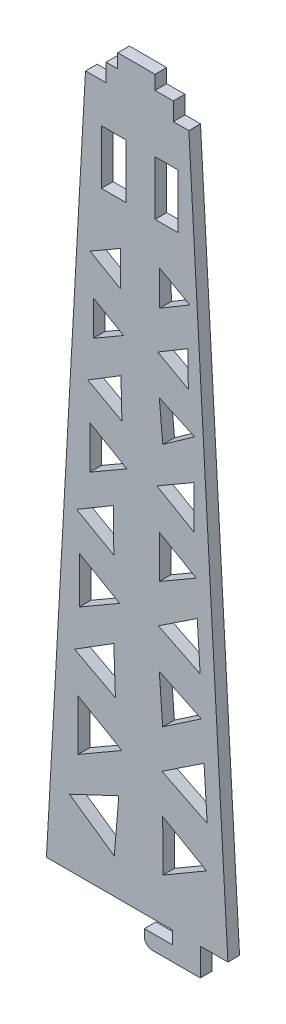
ISO-10303-21;
HEADER;
FILE_DESCRIPTION(('STEP AP214'),'2;1');
FILE_NAME('part.step','',(''),(''),'','','');
FILE_SCHEMA(('AUTOMOTIVE_DESIGN { 1 0 10303 214 1 1 1 1 }'));
ENDSEC;
DATA;
#1=APPLICATION_CONTEXT('core data for automotive mechanical design processes');
#2=APPLICATION_PROTOCOL_DEFINITION('international standard','automotive_design',2000,#1);
#3=PRODUCT_CONTEXT('',#1,'mechanical');
#4=PRODUCT('Part','Part','',(#3));
#5=PRODUCT_RELATED_PRODUCT_CATEGORY('part','',(#4));
#6=PRODUCT_DEFINITION_FORMATION('','',#4);
#7=PRODUCT_DEFINITION_CONTEXT('part definition',#1,'design');
#8=PRODUCT_DEFINITION('design','',#6,#7);
#9=PRODUCT_DEFINITION_SHAPE('','',#8);
#10=(LENGTH_UNIT() NAMED_UNIT(*) SI_UNIT(.MILLI.,.METRE.));
#11=(NAMED_UNIT(*) PLANE_ANGLE_UNIT() SI_UNIT($,.RADIAN.));
#12=(NAMED_UNIT(*) SI_UNIT($,.STERADIAN.) SOLID_ANGLE_UNIT());
#13=UNCERTAINTY_MEASURE_WITH_UNIT(LENGTH_MEASURE(1.E-05),#10,'distance_accuracy_value','');
#14=(GEOMETRIC_REPRESENTATION_CONTEXT(3) GLOBAL_UNCERTAINTY_ASSIGNED_CONTEXT((#13)) GLOBAL_UNIT_ASSIGNED_CONTEXT((#10,
#11,#12)) REPRESENTATION_CONTEXT('',''));
#15=CARTESIAN_POINT('',(0.,0.,0.));
#16=DIRECTION('',(0.,0.,1.));
#17=DIRECTION('',(1.,0.,0.));
#18=AXIS2_PLACEMENT_3D('',#15,#16,#17);
#19=CARTESIAN_POINT('',(0.,170.127892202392,3.));
#20=DIRECTION('',(0.,1.,0.));
#21=DIRECTION('',(0.,0.,1.));
#22=AXIS2_PLACEMENT_3D('',#19,#20,#21);
#23=PLANE('',#22);
#24=DIRECTION('',(1.,0.,0.));
#25=VECTOR('',#24,1.);
#26=CARTESIAN_POINT('',(0.,170.127892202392,0.));
#27=LINE('',#26,#25);
#28=CARTESIAN_POINT('',(4.6000633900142,170.127892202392,0.));
#29=VERTEX_POINT('',#28);
#30=CARTESIAN_POINT('',(10.5079842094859,170.127892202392,0.));
#31=VERTEX_POINT('',#30);
#32=EDGE_CURVE('E882',#29,#31,#27,.T.);
#33=ORIENTED_EDGE('',*,*,#32,.T.);
#34=DIRECTION('',(0.,0.,-1.));
#35=VECTOR('',#34,1.);
#36=CARTESIAN_POINT('',(10.5079842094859,170.127892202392,3.));
#37=LINE('',#36,#35);
#38=CARTESIAN_POINT('',(10.5079842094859,170.127892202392,3.));
#39=VERTEX_POINT('',#38);
#40=EDGE_CURVE('E11',#39,#31,#37,.T.);
#41=ORIENTED_EDGE('',*,*,#40,.F.);
#42=DIRECTION('',(1.,0.,0.));
#43=VECTOR('',#42,1.);
#44=CARTESIAN_POINT('',(0.,170.127892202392,3.));
#45=LINE('',#44,#43);
#46=CARTESIAN_POINT('',(4.6000633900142,170.127892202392,3.));
#47=VERTEX_POINT('',#46);
#48=EDGE_CURVE('E563',#47,#39,#45,.T.);
#49=ORIENTED_EDGE('',*,*,#48,.F.);
#50=DIRECTION('',(0.,0.,-1.));
#51=VECTOR('',#50,1.);
#52=CARTESIAN_POINT('',(4.6000633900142,170.127892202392,3.));
#53=LINE('',#52,#51);
#54=EDGE_CURVE('E65',#47,#29,#53,.T.);
#55=ORIENTED_EDGE('',*,*,#54,.T.);
#56=EDGE_LOOP('',(#33,#41,#49,#55));
#57=FACE_BOUND('',#56,.T.);
#58=ADVANCED_FACE('F45',(#57),#23,.F.);
#59=CARTESIAN_POINT('',(10.5079842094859,0.,3.));
#60=DIRECTION('',(1.,0.,0.));
#61=DIRECTION('',(0.,0.,-1.));
#62=AXIS2_PLACEMENT_3D('',#59,#60,#61);
#63=PLANE('',#62);
#64=DIRECTION('',(0.,-1.,0.));
#65=VECTOR('',#64,1.);
#66=CARTESIAN_POINT('',(10.5079842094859,0.,0.));
#67=LINE('',#66,#65);
#68=CARTESIAN_POINT('',(10.5079842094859,156.165394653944,0.));
#69=VERTEX_POINT('',#68);
#70=EDGE_CURVE('E570',#31,#69,#67,.T.);
#71=ORIENTED_EDGE('',*,*,#70,.T.);
#72=DIRECTION('',(0.,0.,-1.));
#73=VECTOR('',#72,1.);
#74=CARTESIAN_POINT('',(10.5079842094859,156.165394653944,3.));
#75=LINE('',#74,#73);
#76=CARTESIAN_POINT('',(10.5079842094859,156.165394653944,3.));
#77=VERTEX_POINT('',#76);
#78=EDGE_CURVE('E56',#77,#69,#75,.T.);
#79=ORIENTED_EDGE('',*,*,#78,.F.);
#80=DIRECTION('',(0.,-1.,0.));
#81=VECTOR('',#80,1.);
#82=CARTESIAN_POINT('',(10.5079842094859,0.,3.));
#83=LINE('',#82,#81);
#84=EDGE_CURVE('E557',#39,#77,#83,.T.);
#85=ORIENTED_EDGE('',*,*,#84,.F.);
#86=ORIENTED_EDGE('',*,*,#40,.T.);
#87=EDGE_LOOP('',(#71,#79,#85,#86));
#88=FACE_BOUND('',#87,.T.);
#89=ADVANCED_FACE('F569',(#88),#63,.F.);
#90=CARTESIAN_POINT('',(0.,156.165394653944,3.));
#91=DIRECTION('',(0.,1.,0.));
#92=DIRECTION('',(0.,0.,1.));
#93=AXIS2_PLACEMENT_3D('',#90,#91,#92);
#94=PLANE('',#93);
#95=DIRECTION('',(1.,0.,0.));
#96=VECTOR('',#95,1.);
#97=CARTESIAN_POINT('',(0.,156.165394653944,0.));
#98=LINE('',#97,#96);
#99=CARTESIAN_POINT('',(4.6000633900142,156.165394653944,0.));
#100=VERTEX_POINT('',#99);
#101=EDGE_CURVE('E887',#100,#69,#98,.T.);
#102=ORIENTED_EDGE('',*,*,#101,.F.);
#103=DIRECTION('',(0.,0.,-1.));
#104=VECTOR('',#103,1.);
#105=CARTESIAN_POINT('',(4.6000633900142,156.165394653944,3.));
#106=LINE('',#105,#104);
#107=CARTESIAN_POINT('',(4.6000633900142,156.165394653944,3.));
#108=VERTEX_POINT('',#107);
#109=EDGE_CURVE('E310',#108,#100,#106,.T.);
#110=ORIENTED_EDGE('',*,*,#109,.F.);
#111=DIRECTION('',(1.,0.,0.));
#112=VECTOR('',#111,1.);
#113=CARTESIAN_POINT('',(0.,156.165394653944,3.));
#114=LINE('',#113,#112);
#115=EDGE_CURVE('E562',#108,#77,#114,.T.);
#116=ORIENTED_EDGE('',*,*,#115,.T.);
#117=ORIENTED_EDGE('',*,*,#78,.T.);
#118=EDGE_LOOP('',(#102,#110,#116,#117));
#119=FACE_BOUND('',#118,.T.);
#120=ADVANCED_FACE('F575',(#119),#94,.T.);
#121=CARTESIAN_POINT('',(11.9897309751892,20.9290278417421,3.));
#122=DIRECTION('',(-0.497085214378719,-0.867701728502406,0.));
#123=DIRECTION('',(0.867701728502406,-0.497085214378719,0.));
#124=AXIS2_PLACEMENT_3D('',#121,#122,#123);
#125=PLANE('',#124);
#126=DIRECTION('',(-0.867701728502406,0.497085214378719,0.));
#127=VECTOR('',#126,1.);
#128=CARTESIAN_POINT('',(11.9897309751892,20.9290278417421,0.));
#129=LINE('',#128,#127);
#130=CARTESIAN_POINT('',(17.8543583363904,17.5693254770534,0.));
#131=VERTEX_POINT('',#130);
#132=CARTESIAN_POINT('',(6.57423586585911,24.0314332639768,0.));
#133=VERTEX_POINT('',#132);
#134=EDGE_CURVE('E870',#131,#133,#129,.T.);
#135=ORIENTED_EDGE('',*,*,#134,.F.);
#136=DIRECTION('',(0.,0.,-1.));
#137=VECTOR('',#136,1.);
#138=CARTESIAN_POINT('',(17.8543583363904,17.5693254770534,3.));
#139=LINE('',#138,#137);
#140=CARTESIAN_POINT('',(17.8543583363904,17.5693254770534,3.));
#141=VERTEX_POINT('',#140);
#142=EDGE_CURVE('E897',#141,#131,#139,.T.);
#143=ORIENTED_EDGE('',*,*,#142,.F.);
#144=DIRECTION('',(-0.867701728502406,0.497085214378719,0.));
#145=VECTOR('',#144,1.);
#146=CARTESIAN_POINT('',(11.9897309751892,20.9290278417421,3.));
#147=LINE('',#146,#145);
#148=CARTESIAN_POINT('',(6.57423586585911,24.0314332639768,3.));
#149=VERTEX_POINT('',#148);
#150=EDGE_CURVE('E1400',#141,#149,#147,.T.);
#151=ORIENTED_EDGE('',*,*,#150,.T.);
#152=DIRECTION('',(0.,0.,-1.));
#153=VECTOR('',#152,1.);
#154=CARTESIAN_POINT('',(6.57423586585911,24.0314332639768,3.));
#155=LINE('',#154,#153);
#156=EDGE_CURVE('E900',#149,#133,#155,.T.);
#157=ORIENTED_EDGE('',*,*,#156,.T.);
#158=EDGE_LOOP('',(#135,#143,#151,#157));
#159=FACE_BOUND('',#158,.T.);
#160=ADVANCED_FACE('F1426',(#159),#125,.T.);
#161=CARTESIAN_POINT('',(-3.12142542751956,5.36472785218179,3.));
#162=DIRECTION('',(-0.502909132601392,0.864339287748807,0.));
#163=DIRECTION('',(-0.864339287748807,-0.502909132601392,0.));
#164=AXIS2_PLACEMENT_3D('',#161,#162,#163);
#165=PLANE('',#164);
#166=DIRECTION('',(0.864339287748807,0.502909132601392,0.));
#167=VECTOR('',#166,1.);
#168=CARTESIAN_POINT('',(-3.12142542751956,5.36472785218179,0.));
#169=LINE('',#168,#167);
#170=CARTESIAN_POINT('',(6.61794759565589,11.0315067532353,0.));
#171=VERTEX_POINT('',#170);
#172=EDGE_CURVE('E874',#171,#131,#169,.T.);
#173=ORIENTED_EDGE('',*,*,#172,.F.);
#174=DIRECTION('',(0.,0.,-1.));
#175=VECTOR('',#174,1.);
#176=CARTESIAN_POINT('',(6.61794759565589,11.0315067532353,3.));
#177=LINE('',#176,#175);
#178=CARTESIAN_POINT('',(6.61794759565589,11.0315067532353,3.));
#179=VERTEX_POINT('',#178);
#180=EDGE_CURVE('E903',#179,#171,#177,.T.);
#181=ORIENTED_EDGE('',*,*,#180,.F.);
#182=DIRECTION('',(0.864339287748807,0.502909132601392,0.));
#183=VECTOR('',#182,1.);
#184=CARTESIAN_POINT('',(-3.12142542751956,5.36472785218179,3.));
#185=LINE('',#184,#183);
#186=EDGE_CURVE('E1404',#179,#141,#185,.T.);
#187=ORIENTED_EDGE('',*,*,#186,.T.);
#188=ORIENTED_EDGE('',*,*,#142,.T.);
#189=EDGE_LOOP('',(#173,#181,#187,#188));
#190=FACE_BOUND('',#189,.T.);
#191=ADVANCED_FACE('F1421',(#190),#165,.T.);
#192=CARTESIAN_POINT('',(-18.4030240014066,27.0191820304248,3.));
#193=DIRECTION('',(-0.562936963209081,0.826499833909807,0.));
#194=DIRECTION('',(-0.826499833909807,-0.562936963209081,0.));
#195=AXIS2_PLACEMENT_3D('',#192,#193,#194);
#196=PLANE('',#195);
#197=DIRECTION('',(0.826499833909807,0.562936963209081,0.));
#198=VECTOR('',#197,1.);
#199=CARTESIAN_POINT('',(-18.4030240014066,27.0191820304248,0.));
#200=LINE('',#199,#198);
#201=CARTESIAN_POINT('',(6.5742358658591,44.0314332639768,0.));
#202=VERTEX_POINT('',#201);
#203=CARTESIAN_POINT('',(16.4922338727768,50.7866768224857,0.));
#204=VERTEX_POINT('',#203);
#205=EDGE_CURVE('E858',#202,#204,#200,.T.);
#206=ORIENTED_EDGE('',*,*,#205,.F.);
#207=DIRECTION('',(0.,0.,-1.));
#208=VECTOR('',#207,1.);
#209=CARTESIAN_POINT('',(6.5742358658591,44.0314332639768,3.));
#210=LINE('',#209,#208);
#211=CARTESIAN_POINT('',(6.5742358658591,44.0314332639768,3.));
#212=VERTEX_POINT('',#211);
#213=EDGE_CURVE('E904',#212,#202,#210,.T.);
#214=ORIENTED_EDGE('',*,*,#213,.F.);
#215=DIRECTION('',(0.826499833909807,0.562936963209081,0.));
#216=VECTOR('',#215,1.);
#217=CARTESIAN_POINT('',(-18.4030240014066,27.0191820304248,3.));
#218=LINE('',#217,#216);
#219=CARTESIAN_POINT('',(16.4922338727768,50.7866768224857,3.));
#220=VERTEX_POINT('',#219);
#221=EDGE_CURVE('E1388',#212,#220,#218,.T.);
#222=ORIENTED_EDGE('',*,*,#221,.T.);
#223=DIRECTION('',(0.,0.,-1.));
#224=VECTOR('',#223,1.);
#225=CARTESIAN_POINT('',(16.4922338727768,50.7866768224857,3.));
#226=LINE('',#225,#224);
#227=EDGE_CURVE('E909',#220,#204,#226,.T.);
#228=ORIENTED_EDGE('',*,*,#227,.T.);
#229=EDGE_LOOP('',(#206,#214,#222,#228));
#230=FACE_BOUND('',#229,.T.);
#231=ADVANCED_FACE('F1433',(#230),#196,.T.);
#232=CARTESIAN_POINT('',(9.79906075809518,0.729770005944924,3.));
#233=DIRECTION('',(0.997238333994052,0.0742677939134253,0.));
#234=DIRECTION('',(-0.0742677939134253,0.997238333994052,0.));
#235=AXIS2_PLACEMENT_3D('',#232,#233,#234);
#236=PLANE('',#235);
#237=DIRECTION('',(0.0742677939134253,-0.997238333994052,0.));
#238=VECTOR('',#237,1.);
#239=CARTESIAN_POINT('',(9.79906075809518,0.729770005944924,0.));
#240=LINE('',#239,#238);
#241=CARTESIAN_POINT('',(5.683022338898,55.9982932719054,0.));
#242=VERTEX_POINT('',#241);
#243=EDGE_CURVE('E862',#242,#202,#240,.T.);
#244=ORIENTED_EDGE('',*,*,#243,.F.);
#245=DIRECTION('',(0.,0.,-1.));
#246=VECTOR('',#245,1.);
#247=CARTESIAN_POINT('',(5.683022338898,55.9982932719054,3.));
#248=LINE('',#247,#246);
#249=CARTESIAN_POINT('',(5.683022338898,55.9982932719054,3.));
#250=VERTEX_POINT('',#249);
#251=EDGE_CURVE('E912',#250,#242,#248,.T.);
#252=ORIENTED_EDGE('',*,*,#251,.F.);
#253=DIRECTION('',(0.0742677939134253,-0.997238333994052,0.));
#254=VECTOR('',#253,1.);
#255=CARTESIAN_POINT('',(9.79906075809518,0.729770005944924,3.));
#256=LINE('',#255,#254);
#257=EDGE_CURVE('E1392',#250,#212,#256,.T.);
#258=ORIENTED_EDGE('',*,*,#257,.T.);
#259=ORIENTED_EDGE('',*,*,#213,.T.);
#260=EDGE_LOOP('',(#244,#252,#258,#259));
#261=FACE_BOUND('',#260,.T.);
#262=ADVANCED_FACE('F1717',(#261),#236,.T.);
#263=CARTESIAN_POINT('',(5.68302233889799,0.,3.));
#264=DIRECTION('',(1.,0.,0.));
#265=DIRECTION('',(0.,1.,0.));
#266=AXIS2_PLACEMENT_3D('',#263,#264,#265);
#267=PLANE('',#266);
#268=DIRECTION('',(0.,-1.,0.));
#269=VECTOR('',#268,1.);
#270=CARTESIAN_POINT('',(5.68302233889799,0.,0.));
#271=LINE('',#270,#269);
#272=CARTESIAN_POINT('',(5.683022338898,86.9982932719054,0.));
#273=VERTEX_POINT('',#272);
#274=CARTESIAN_POINT('',(5.683022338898,75.9982932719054,0.));
#275=VERTEX_POINT('',#274);
#276=EDGE_CURVE('E846',#273,#275,#271,.T.);
#277=ORIENTED_EDGE('',*,*,#276,.F.);
#278=DIRECTION('',(0.,0.,-1.));
#279=VECTOR('',#278,1.);
#280=CARTESIAN_POINT('',(5.683022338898,86.9982932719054,3.));
#281=LINE('',#280,#279);
#282=CARTESIAN_POINT('',(5.683022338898,86.9982932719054,3.));
#283=VERTEX_POINT('',#282);
#284=EDGE_CURVE('E913',#283,#273,#281,.T.);
#285=ORIENTED_EDGE('',*,*,#284,.F.);
#286=DIRECTION('',(0.,-1.,0.));
#287=VECTOR('',#286,1.);
#288=CARTESIAN_POINT('',(5.68302233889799,0.,3.));
#289=LINE('',#288,#287);
#290=CARTESIAN_POINT('',(5.683022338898,75.9982932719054,3.));
#291=VERTEX_POINT('',#290);
#292=EDGE_CURVE('E1376',#283,#291,#289,.T.);
#293=ORIENTED_EDGE('',*,*,#292,.T.);
#294=DIRECTION('',(0.,0.,-1.));
#295=VECTOR('',#294,1.);
#296=CARTESIAN_POINT('',(5.683022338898,75.9982932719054,3.));
#297=LINE('',#296,#295);
#298=EDGE_CURVE('E918',#291,#275,#297,.T.);
#299=ORIENTED_EDGE('',*,*,#298,.T.);
#300=EDGE_LOOP('',(#277,#285,#293,#299));
#301=FACE_BOUND('',#300,.T.);
#302=ADVANCED_FACE('F1714',(#301),#267,.T.);
#303=CARTESIAN_POINT('',(39.092121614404,67.709540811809,3.));
#304=DIRECTION('',(-0.500000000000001,-0.866025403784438,0.));
#305=DIRECTION('',(0.866025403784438,-0.500000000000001,0.));
#306=AXIS2_PLACEMENT_3D('',#303,#304,#305);
#307=PLANE('',#306);
#308=DIRECTION('',(-0.866025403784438,0.500000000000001,0.));
#309=VECTOR('',#308,1.);
#310=CARTESIAN_POINT('',(39.092121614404,67.709540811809,0.));
#311=LINE('',#310,#309);
#312=CARTESIAN_POINT('',(15.2093017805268,81.4982932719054,0.));
#313=VERTEX_POINT('',#312);
#314=EDGE_CURVE('E850',#313,#273,#311,.T.);
#315=ORIENTED_EDGE('',*,*,#314,.F.);
#316=DIRECTION('',(0.,0.,-1.));
#317=VECTOR('',#316,1.);
#318=CARTESIAN_POINT('',(15.2093017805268,81.4982932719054,3.));
#319=LINE('',#318,#317);
#320=CARTESIAN_POINT('',(15.2093017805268,81.4982932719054,3.));
#321=VERTEX_POINT('',#320);
#322=EDGE_CURVE('E921',#321,#313,#319,.T.);
#323=ORIENTED_EDGE('',*,*,#322,.F.);
#324=DIRECTION('',(-0.866025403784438,0.500000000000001,0.));
#325=VECTOR('',#324,1.);
#326=CARTESIAN_POINT('',(39.092121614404,67.709540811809,3.));
#327=LINE('',#326,#325);
#328=EDGE_CURVE('E1380',#321,#283,#327,.T.);
#329=ORIENTED_EDGE('',*,*,#328,.T.);
#330=ORIENTED_EDGE('',*,*,#284,.T.);
#331=EDGE_LOOP('',(#315,#323,#329,#330));
#332=FACE_BOUND('',#331,.T.);
#333=ADVANCED_FACE('F1706',(#332),#307,.T.);
#334=CARTESIAN_POINT('',(16.3616756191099,1.51348916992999,3.));
#335=DIRECTION('',(0.9957489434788,0.0921088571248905,0.));
#336=DIRECTION('',(-0.0921088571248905,0.9957489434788,0.));
#337=AXIS2_PLACEMENT_3D('',#334,#335,#336);
#338=PLANE('',#337);
#339=DIRECTION('',(0.0921088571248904,-0.9957489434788,0.));
#340=VECTOR('',#339,1.);
#341=CARTESIAN_POINT('',(16.3616756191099,1.51348916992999,0.));
#342=LINE('',#341,#340);
#343=CARTESIAN_POINT('',(5.68302233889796,116.955782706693,0.));
#344=VERTEX_POINT('',#343);
#345=CARTESIAN_POINT('',(6.60411091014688,106.998293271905,0.));
#346=VERTEX_POINT('',#345);
#347=EDGE_CURVE('E834',#344,#346,#342,.T.);
#348=ORIENTED_EDGE('',*,*,#347,.F.);
#349=DIRECTION('',(0.,0.,-1.));
#350=VECTOR('',#349,1.);
#351=CARTESIAN_POINT('',(5.68302233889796,116.955782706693,3.));
#352=LINE('',#351,#350);
#353=CARTESIAN_POINT('',(5.68302233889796,116.955782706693,3.));
#354=VERTEX_POINT('',#353);
#355=EDGE_CURVE('E922',#354,#344,#352,.T.);
#356=ORIENTED_EDGE('',*,*,#355,.F.);
#357=DIRECTION('',(0.0921088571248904,-0.9957489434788,0.));
#358=VECTOR('',#357,1.);
#359=CARTESIAN_POINT('',(16.3616756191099,1.51348916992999,3.));
#360=LINE('',#359,#358);
#361=CARTESIAN_POINT('',(6.60411091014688,106.998293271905,3.));
#362=VERTEX_POINT('',#361);
#363=EDGE_CURVE('E1364',#354,#362,#360,.T.);
#364=ORIENTED_EDGE('',*,*,#363,.T.);
#365=DIRECTION('',(0.,0.,-1.));
#366=VECTOR('',#365,1.);
#367=CARTESIAN_POINT('',(6.60411091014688,106.998293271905,3.));
#368=LINE('',#367,#366);
#369=EDGE_CURVE('E927',#362,#346,#368,.T.);
#370=ORIENTED_EDGE('',*,*,#369,.T.);
#371=EDGE_LOOP('',(#348,#356,#364,#370));
#372=FACE_BOUND('',#371,.T.);
#373=ADVANCED_FACE('F1703',(#372),#338,.T.);
#374=CARTESIAN_POINT('',(45.4140483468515,98.6688983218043,3.));
#375=DIRECTION('',(-0.418105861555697,-0.9083983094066,0.));
#376=DIRECTION('',(0.9083983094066,-0.418105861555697,0.));
#377=AXIS2_PLACEMENT_3D('',#374,#375,#376);
#378=PLANE('',#377);
#379=DIRECTION('',(-0.9083983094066,0.418105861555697,0.));
#380=VECTOR('',#379,1.);
#381=CARTESIAN_POINT('',(45.4140483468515,98.6688983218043,0.));
#382=LINE('',#381,#380);
#383=CARTESIAN_POINT('',(14.767005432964,112.774724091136,0.));
#384=VERTEX_POINT('',#383);
#385=EDGE_CURVE('E838',#384,#344,#382,.T.);
#386=ORIENTED_EDGE('',*,*,#385,.F.);
#387=DIRECTION('',(0.,0.,-1.));
#388=VECTOR('',#387,1.);
#389=CARTESIAN_POINT('',(14.767005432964,112.774724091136,3.));
#390=LINE('',#389,#388);
#391=CARTESIAN_POINT('',(14.767005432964,112.774724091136,3.));
#392=VERTEX_POINT('',#391);
#393=EDGE_CURVE('E930',#392,#384,#390,.T.);
#394=ORIENTED_EDGE('',*,*,#393,.F.);
#395=DIRECTION('',(-0.9083983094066,0.418105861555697,0.));
#396=VECTOR('',#395,1.);
#397=CARTESIAN_POINT('',(45.4140483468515,98.6688983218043,3.));
#398=LINE('',#397,#396);
#399=EDGE_CURVE('E1368',#392,#354,#398,.T.);
#400=ORIENTED_EDGE('',*,*,#399,.T.);
#401=ORIENTED_EDGE('',*,*,#355,.T.);
#402=EDGE_LOOP('',(#386,#394,#400,#401));
#403=FACE_BOUND('',#402,.T.);
#404=ADVANCED_FACE('F1694',(#403),#378,.T.);
#405=CARTESIAN_POINT('',(7.43863141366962,0.0895300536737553,3.));
#406=DIRECTION('',(0.999927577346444,0.0120349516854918,0.));
#407=DIRECTION('',(-0.0120349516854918,0.999927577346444,0.));
#408=AXIS2_PLACEMENT_3D('',#405,#406,#407);
#409=PLANE('',#408);
#410=DIRECTION('',(0.0120349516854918,-0.999927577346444,0.));
#411=VECTOR('',#410,1.);
#412=CARTESIAN_POINT('',(7.43863141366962,0.0895300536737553,0.));
#413=LINE('',#412,#411);
#414=CARTESIAN_POINT('',(5.68302233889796,145.954837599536,0.));
#415=VERTEX_POINT('',#414);
#416=CARTESIAN_POINT('',(5.79133690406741,136.955489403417,0.));
#417=VERTEX_POINT('',#416);
#418=EDGE_CURVE('E822',#415,#417,#413,.T.);
#419=ORIENTED_EDGE('',*,*,#418,.F.);
#420=DIRECTION('',(0.,0.,-1.));
#421=VECTOR('',#420,1.);
#422=CARTESIAN_POINT('',(5.68302233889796,145.954837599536,3.));
#423=LINE('',#422,#421);
#424=CARTESIAN_POINT('',(5.68302233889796,145.954837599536,3.));
#425=VERTEX_POINT('',#424);
#426=EDGE_CURVE('E931',#425,#415,#423,.T.);
#427=ORIENTED_EDGE('',*,*,#426,.F.);
#428=DIRECTION('',(0.0120349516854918,-0.999927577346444,0.));
#429=VECTOR('',#428,1.);
#430=CARTESIAN_POINT('',(7.43863141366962,0.0895300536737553,3.));
#431=LINE('',#430,#429);
#432=CARTESIAN_POINT('',(5.79133690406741,136.955489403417,3.));
#433=VERTEX_POINT('',#432);
#434=EDGE_CURVE('E1352',#425,#433,#431,.T.);
#435=ORIENTED_EDGE('',*,*,#434,.T.);
#436=DIRECTION('',(0.,0.,-1.));
#437=VECTOR('',#436,1.);
#438=CARTESIAN_POINT('',(5.79133690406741,136.955489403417,3.));
#439=LINE('',#438,#437);
#440=EDGE_CURVE('E936',#433,#417,#439,.T.);
#441=ORIENTED_EDGE('',*,*,#440,.T.);
#442=EDGE_LOOP('',(#419,#427,#435,#441));
#443=FACE_BOUND('',#442,.T.);
#444=ADVANCED_FACE('F1691',(#443),#409,.T.);
#445=CARTESIAN_POINT('',(63.6657143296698,113.402586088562,3.));
#446=DIRECTION('',(-0.489541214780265,-0.871980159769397,0.));
#447=DIRECTION('',(0.871980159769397,-0.489541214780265,0.));
#448=AXIS2_PLACEMENT_3D('',#445,#446,#447);
#449=PLANE('',#448);
#450=DIRECTION('',(-0.871980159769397,0.489541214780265,0.));
#451=VECTOR('',#450,1.);
#452=CARTESIAN_POINT('',(63.6657143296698,113.402586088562,0.));
#453=LINE('',#452,#451);
#454=CARTESIAN_POINT('',(13.5308437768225,141.548966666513,0.));
#455=VERTEX_POINT('',#454);
#456=EDGE_CURVE('E826',#455,#415,#453,.T.);
#457=ORIENTED_EDGE('',*,*,#456,.F.);
#458=DIRECTION('',(0.,0.,-1.));
#459=VECTOR('',#458,1.);
#460=CARTESIAN_POINT('',(13.5308437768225,141.548966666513,3.));
#461=LINE('',#460,#459);
#462=CARTESIAN_POINT('',(13.5308437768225,141.548966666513,3.));
#463=VERTEX_POINT('',#462);
#464=EDGE_CURVE('E939',#463,#455,#461,.T.);
#465=ORIENTED_EDGE('',*,*,#464,.F.);
#466=DIRECTION('',(-0.871980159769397,0.489541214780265,0.));
#467=VECTOR('',#466,1.);
#468=CARTESIAN_POINT('',(63.6657143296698,113.402586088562,3.));
#469=LINE('',#468,#467);
#470=EDGE_CURVE('E1356',#463,#425,#469,.T.);
#471=ORIENTED_EDGE('',*,*,#470,.T.);
#472=ORIENTED_EDGE('',*,*,#426,.T.);
#473=EDGE_LOOP('',(#457,#465,#471,#472));
#474=FACE_BOUND('',#473,.T.);
#475=ADVANCED_FACE('F1682',(#474),#449,.T.);
#476=CARTESIAN_POINT('',(14.7870839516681,0.195966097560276,3.));
#477=DIRECTION('',(-0.999912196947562,-0.0132513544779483,0.));
#478=DIRECTION('',(0.0132513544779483,-0.999912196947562,0.));
#479=AXIS2_PLACEMENT_3D('',#476,#477,#478);
#480=PLANE('',#479);
#481=DIRECTION('',(-0.0132513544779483,0.999912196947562,0.));
#482=VECTOR('',#481,1.);
#483=CARTESIAN_POINT('',(14.7870839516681,0.195966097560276,0.));
#484=LINE('',#483,#482);
#485=CARTESIAN_POINT('',(13.1654633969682,122.559168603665,0.));
#486=VERTEX_POINT('',#485);
#487=CARTESIAN_POINT('',(13.0462012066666,131.558378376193,0.));
#488=VERTEX_POINT('',#487);
#489=EDGE_CURVE('E810',#486,#488,#484,.T.);
#490=ORIENTED_EDGE('',*,*,#489,.F.);
#491=DIRECTION('',(0.,0.,-1.));
#492=VECTOR('',#491,1.);
#493=CARTESIAN_POINT('',(13.1654633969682,122.559168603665,3.));
#494=LINE('',#493,#492);
#495=CARTESIAN_POINT('',(13.1654633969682,122.559168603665,3.));
#496=VERTEX_POINT('',#495);
#497=EDGE_CURVE('E940',#496,#486,#494,.T.);
#498=ORIENTED_EDGE('',*,*,#497,.F.);
#499=DIRECTION('',(-0.0132513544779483,0.999912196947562,0.));
#500=VECTOR('',#499,1.);
#501=CARTESIAN_POINT('',(14.7870839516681,0.195966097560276,3.));
#502=LINE('',#501,#500);
#503=CARTESIAN_POINT('',(13.0462012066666,131.558378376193,3.));
#504=VERTEX_POINT('',#503);
#505=EDGE_CURVE('E1340',#496,#504,#502,.T.);
#506=ORIENTED_EDGE('',*,*,#505,.T.);
#507=DIRECTION('',(0.,0.,-1.));
#508=VECTOR('',#507,1.);
#509=CARTESIAN_POINT('',(13.0462012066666,131.558378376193,3.));
#510=LINE('',#509,#508);
#511=EDGE_CURVE('E945',#504,#488,#510,.T.);
#512=ORIENTED_EDGE('',*,*,#511,.T.);
#513=EDGE_LOOP('',(#490,#498,#506,#512));
#514=FACE_BOUND('',#513,.T.);
#515=ADVANCED_FACE('F1679',(#514),#480,.T.);
#516=CARTESIAN_POINT('',(55.3805206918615,98.9265708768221,3.));
#517=DIRECTION('',(0.488480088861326,0.872575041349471,0.));
#518=DIRECTION('',(-0.872575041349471,0.488480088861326,0.));
#519=AXIS2_PLACEMENT_3D('',#516,#517,#518);
#520=PLANE('',#519);
#521=DIRECTION('',(0.872575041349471,-0.488480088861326,0.));
#522=VECTOR('',#521,1.);
#523=CARTESIAN_POINT('',(55.3805206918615,98.9265708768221,0.));
#524=LINE('',#523,#522);
#525=CARTESIAN_POINT('',(5.31228802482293,126.955489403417,0.));
#526=VERTEX_POINT('',#525);
#527=EDGE_CURVE('E814',#526,#486,#524,.T.);
#528=ORIENTED_EDGE('',*,*,#527,.F.);
#529=DIRECTION('',(0.,0.,-1.));
#530=VECTOR('',#529,1.);
#531=CARTESIAN_POINT('',(5.31228802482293,126.955489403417,3.));
#532=LINE('',#531,#530);
#533=CARTESIAN_POINT('',(5.31228802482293,126.955489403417,3.));
#534=VERTEX_POINT('',#533);
#535=EDGE_CURVE('E948',#534,#526,#532,.T.);
#536=ORIENTED_EDGE('',*,*,#535,.F.);
#537=DIRECTION('',(0.872575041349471,-0.488480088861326,0.));
#538=VECTOR('',#537,1.);
#539=CARTESIAN_POINT('',(55.3805206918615,98.9265708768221,3.));
#540=LINE('',#539,#538);
#541=EDGE_CURVE('E1344',#534,#496,#540,.T.);
#542=ORIENTED_EDGE('',*,*,#541,.T.);
#543=ORIENTED_EDGE('',*,*,#497,.T.);
#544=EDGE_LOOP('',(#528,#536,#542,#543));
#545=FACE_BOUND('',#544,.T.);
#546=ADVANCED_FACE('F1670',(#545),#520,.T.);
#547=CARTESIAN_POINT('',(-40.7362280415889,70.5572166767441,3.));
#548=DIRECTION('',(0.499999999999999,-0.866025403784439,0.));
#549=DIRECTION('',(0.866025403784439,0.499999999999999,0.));
#550=AXIS2_PLACEMENT_3D('',#547,#548,#549);
#551=PLANE('',#550);
#552=DIRECTION('',(-0.866025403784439,-0.5,0.));
#553=VECTOR('',#552,1.);
#554=CARTESIAN_POINT('',(-40.7362280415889,70.5572166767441,0.));
#555=LINE('',#554,#553);
#556=CARTESIAN_POINT('',(14.5873394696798,102.498293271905,0.));
#557=VERTEX_POINT('',#556);
#558=CARTESIAN_POINT('',(5.06106002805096,96.9982932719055,0.));
#559=VERTEX_POINT('',#558);
#560=EDGE_CURVE('E798',#557,#559,#555,.T.);
#561=ORIENTED_EDGE('',*,*,#560,.F.);
#562=DIRECTION('',(0.,0.,-1.));
#563=VECTOR('',#562,1.);
#564=CARTESIAN_POINT('',(14.5873394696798,102.498293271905,3.));
#565=LINE('',#564,#563);
#566=CARTESIAN_POINT('',(14.5873394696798,102.498293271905,3.));
#567=VERTEX_POINT('',#566);
#568=EDGE_CURVE('E949',#567,#557,#565,.T.);
#569=ORIENTED_EDGE('',*,*,#568,.F.);
#570=DIRECTION('',(-0.866025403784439,-0.5,0.));
#571=VECTOR('',#570,1.);
#572=CARTESIAN_POINT('',(-40.7362280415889,70.5572166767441,3.));
#573=LINE('',#572,#571);
#574=CARTESIAN_POINT('',(5.06106002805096,96.9982932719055,3.));
#575=VERTEX_POINT('',#574);
#576=EDGE_CURVE('E1328',#567,#575,#573,.T.);
#577=ORIENTED_EDGE('',*,*,#576,.T.);
#578=DIRECTION('',(0.,0.,-1.));
#579=VECTOR('',#578,1.);
#580=CARTESIAN_POINT('',(5.06106002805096,96.9982932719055,3.));
#581=LINE('',#580,#579);
#582=EDGE_CURVE('E954',#575,#559,#581,.T.);
#583=ORIENTED_EDGE('',*,*,#582,.T.);
#584=EDGE_LOOP('',(#561,#569,#577,#583));
#585=FACE_BOUND('',#584,.T.);
#586=ADVANCED_FACE('F1667',(#585),#551,.T.);
#587=CARTESIAN_POINT('',(14.5873394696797,0.,3.));
#588=DIRECTION('',(-1.,0.,0.));
#589=DIRECTION('',(0.,-1.,0.));
#590=AXIS2_PLACEMENT_3D('',#587,#588,#589);
#591=PLANE('',#590);
#592=DIRECTION('',(0.,1.,0.));
#593=VECTOR('',#592,1.);
#594=CARTESIAN_POINT('',(14.5873394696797,0.,0.));
#595=LINE('',#594,#593);
#596=CARTESIAN_POINT('',(14.5873394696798,91.4982932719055,0.));
#597=VERTEX_POINT('',#596);
#598=EDGE_CURVE('E802',#597,#557,#595,.T.);
#599=ORIENTED_EDGE('',*,*,#598,.F.);
#600=DIRECTION('',(0.,0.,-1.));
#601=VECTOR('',#600,1.);
#602=CARTESIAN_POINT('',(14.5873394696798,91.4982932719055,3.));
#603=LINE('',#602,#601);
#604=CARTESIAN_POINT('',(14.5873394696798,91.4982932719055,3.));
#605=VERTEX_POINT('',#604);
#606=EDGE_CURVE('E957',#605,#597,#603,.T.);
#607=ORIENTED_EDGE('',*,*,#606,.F.);
#608=DIRECTION('',(0.,1.,0.));
#609=VECTOR('',#608,1.);
#610=CARTESIAN_POINT('',(14.5873394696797,0.,3.));
#611=LINE('',#610,#609);
#612=EDGE_CURVE('E1332',#605,#567,#611,.T.);
#613=ORIENTED_EDGE('',*,*,#612,.T.);
#614=ORIENTED_EDGE('',*,*,#568,.T.);
#615=EDGE_LOOP('',(#599,#607,#613,#614));
#616=FACE_BOUND('',#615,.T.);
#617=ADVANCED_FACE('F1658',(#616),#591,.T.);
#618=CARTESIAN_POINT('',(19.890394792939,1.23412366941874,3.));
#619=DIRECTION('',(-0.998080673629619,-0.0619271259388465,0.));
#620=DIRECTION('',(0.0619271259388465,-0.998080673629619,0.));
#621=AXIS2_PLACEMENT_3D('',#618,#619,#620);
#622=PLANE('',#621);
#623=DIRECTION('',(-0.0619271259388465,0.998080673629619,0.));
#624=VECTOR('',#623,1.);
#625=CARTESIAN_POINT('',(19.890394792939,1.23412366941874,0.));
#626=LINE('',#625,#624);
#627=CARTESIAN_POINT('',(16.203655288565,60.6533748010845,0.));
#628=VERTEX_POINT('',#627);
#629=CARTESIAN_POINT('',(15.4605297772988,72.6303428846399,0.));
#630=VERTEX_POINT('',#629);
#631=EDGE_CURVE('E786',#628,#630,#626,.T.);
#632=ORIENTED_EDGE('',*,*,#631,.F.);
#633=DIRECTION('',(0.,0.,-1.));
#634=VECTOR('',#633,1.);
#635=CARTESIAN_POINT('',(16.203655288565,60.6533748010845,3.));
#636=LINE('',#635,#634);
#637=CARTESIAN_POINT('',(16.203655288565,60.6533748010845,3.));
#638=VERTEX_POINT('',#637);
#639=EDGE_CURVE('E958',#638,#628,#636,.T.);
#640=ORIENTED_EDGE('',*,*,#639,.F.);
#641=DIRECTION('',(-0.0619271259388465,0.998080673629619,0.));
#642=VECTOR('',#641,1.);
#643=CARTESIAN_POINT('',(19.890394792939,1.23412366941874,3.));
#644=LINE('',#643,#642);
#645=CARTESIAN_POINT('',(15.4605297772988,72.6303428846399,3.));
#646=VERTEX_POINT('',#645);
#647=EDGE_CURVE('E1316',#638,#646,#644,.T.);
#648=ORIENTED_EDGE('',*,*,#647,.T.);
#649=DIRECTION('',(0.,0.,-1.));
#650=VECTOR('',#649,1.);
#651=CARTESIAN_POINT('',(15.4605297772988,72.6303428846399,3.));
#652=LINE('',#651,#650);
#653=EDGE_CURVE('E963',#646,#630,#652,.T.);
#654=ORIENTED_EDGE('',*,*,#653,.T.);
#655=EDGE_LOOP('',(#632,#640,#648,#654));
#656=FACE_BOUND('',#655,.T.);
#657=ADVANCED_FACE('F1655',(#656),#622,.T.);
#658=CARTESIAN_POINT('',(27.4024433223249,55.0821678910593,3.));
#659=DIRECTION('',(0.44540987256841,0.895326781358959,0.));
#660=DIRECTION('',(-0.895326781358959,0.44540987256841,0.));
#661=AXIS2_PLACEMENT_3D('',#658,#659,#660);
#662=PLANE('',#661);
#663=DIRECTION('',(0.895326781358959,-0.44540987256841,0.));
#664=VECTOR('',#663,1.);
#665=CARTESIAN_POINT('',(27.4024433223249,55.0821678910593,0.));
#666=LINE('',#665,#664);
#667=CARTESIAN_POINT('',(5.45973391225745,65.9982932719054,0.));
#668=VERTEX_POINT('',#667);
#669=EDGE_CURVE('E790',#668,#628,#666,.T.);
#670=ORIENTED_EDGE('',*,*,#669,.F.);
#671=DIRECTION('',(0.,0.,-1.));
#672=VECTOR('',#671,1.);
#673=CARTESIAN_POINT('',(5.45973391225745,65.9982932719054,3.));
#674=LINE('',#673,#672);
#675=CARTESIAN_POINT('',(5.45973391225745,65.9982932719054,3.));
#676=VERTEX_POINT('',#675);
#677=EDGE_CURVE('E966',#676,#668,#674,.T.);
#678=ORIENTED_EDGE('',*,*,#677,.F.);
#679=DIRECTION('',(0.895326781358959,-0.44540987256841,0.));
#680=VECTOR('',#679,1.);
#681=CARTESIAN_POINT('',(27.4024433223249,55.0821678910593,3.));
#682=LINE('',#681,#680);
#683=EDGE_CURVE('E1320',#676,#638,#682,.T.);
#684=ORIENTED_EDGE('',*,*,#683,.T.);
#685=ORIENTED_EDGE('',*,*,#639,.T.);
#686=EDGE_LOOP('',(#670,#678,#684,#685));
#687=FACE_BOUND('',#686,.T.);
#688=ADVANCED_FACE('F1646',(#687),#662,.T.);
#689=CARTESIAN_POINT('',(-13.7373235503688,20.646417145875,3.));
#690=DIRECTION('',(0.553947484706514,-0.832551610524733,0.));
#691=DIRECTION('',(0.832551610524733,0.553947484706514,0.));
#692=AXIS2_PLACEMENT_3D('',#689,#690,#691);
#693=PLANE('',#692);
#694=DIRECTION('',(-0.832551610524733,-0.553947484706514,0.));
#695=VECTOR('',#694,1.);
#696=CARTESIAN_POINT('',(-13.7373235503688,20.646417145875,0.));
#697=LINE('',#696,#695);
#698=CARTESIAN_POINT('',(17.2027664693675,41.2327505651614,0.));
#699=VERTEX_POINT('',#698);
#700=CARTESIAN_POINT('',(6.37959553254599,34.0314332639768,0.));
#701=VERTEX_POINT('',#700);
#702=EDGE_CURVE('E774',#699,#701,#697,.T.);
#703=ORIENTED_EDGE('',*,*,#702,.F.);
#704=DIRECTION('',(0.,0.,-1.));
#705=VECTOR('',#704,1.);
#706=CARTESIAN_POINT('',(17.2027664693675,41.2327505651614,3.));
#707=LINE('',#706,#705);
#708=CARTESIAN_POINT('',(17.2027664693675,41.2327505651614,3.));
#709=VERTEX_POINT('',#708);
#710=EDGE_CURVE('E967',#709,#699,#707,.T.);
#711=ORIENTED_EDGE('',*,*,#710,.F.);
#712=DIRECTION('',(-0.832551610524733,-0.553947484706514,0.));
#713=VECTOR('',#712,1.);
#714=CARTESIAN_POINT('',(-13.7373235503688,20.646417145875,3.));
#715=LINE('',#714,#713);
#716=CARTESIAN_POINT('',(6.37959553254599,34.0314332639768,3.));
#717=VERTEX_POINT('',#716);
#718=EDGE_CURVE('E1304',#709,#717,#715,.T.);
#719=ORIENTED_EDGE('',*,*,#718,.T.);
#720=DIRECTION('',(0.,0.,-1.));
#721=VECTOR('',#720,1.);
#722=CARTESIAN_POINT('',(6.37959553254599,34.0314332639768,3.));
#723=LINE('',#722,#721);
#724=EDGE_CURVE('E972',#717,#701,#723,.T.);
#725=ORIENTED_EDGE('',*,*,#724,.T.);
#726=EDGE_LOOP('',(#703,#711,#719,#725));
#727=FACE_BOUND('',#726,.T.);
#728=ADVANCED_FACE('F1643',(#727),#693,.T.);
#729=CARTESIAN_POINT('',(19.7447196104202,1.25546678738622,3.));
#730=DIRECTION('',(-0.997984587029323,-0.0634567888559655,0.));
#731=DIRECTION('',(0.0634567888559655,-0.997984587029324,0.));
#732=AXIS2_PLACEMENT_3D('',#729,#730,#731);
#733=PLANE('',#732);
#734=DIRECTION('',(-0.0634567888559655,0.997984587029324,0.));
#735=VECTOR('',#734,1.);
#736=CARTESIAN_POINT('',(19.7447196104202,1.25546678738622,0.));
#737=LINE('',#736,#735);
#738=CARTESIAN_POINT('',(18.0277047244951,28.2589509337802,0.));
#739=VERTEX_POINT('',#738);
#740=EDGE_CURVE('E778',#739,#699,#737,.T.);
#741=ORIENTED_EDGE('',*,*,#740,.F.);
#742=DIRECTION('',(0.,0.,-1.));
#743=VECTOR('',#742,1.);
#744=CARTESIAN_POINT('',(18.0277047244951,28.2589509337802,3.));
#745=LINE('',#744,#743);
#746=CARTESIAN_POINT('',(18.0277047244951,28.2589509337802,3.));
#747=VERTEX_POINT('',#746);
#748=EDGE_CURVE('E975',#747,#739,#745,.T.);
#749=ORIENTED_EDGE('',*,*,#748,.F.);
#750=DIRECTION('',(-0.0634567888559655,0.997984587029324,0.));
#751=VECTOR('',#750,1.);
#752=CARTESIAN_POINT('',(19.7447196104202,1.25546678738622,3.));
#753=LINE('',#752,#751);
#754=EDGE_CURVE('E1308',#747,#709,#753,.T.);
#755=ORIENTED_EDGE('',*,*,#754,.T.);
#756=ORIENTED_EDGE('',*,*,#710,.T.);
#757=EDGE_LOOP('',(#741,#749,#755,#756));
#758=FACE_BOUND('',#757,.T.);
#759=ADVANCED_FACE('F1631',(#758),#733,.T.);
#760=CARTESIAN_POINT('',(-9.22023824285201,0.,3.));
#761=DIRECTION('',(1.,0.,0.));
#762=DIRECTION('',(0.,1.,0.));
#763=AXIS2_PLACEMENT_3D('',#760,#761,#762);
#764=PLANE('',#763);
#765=DIRECTION('',(0.,-1.,0.));
#766=VECTOR('',#765,1.);
#767=CARTESIAN_POINT('',(-9.22023824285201,0.,0.));
#768=LINE('',#767,#766);
#769=CARTESIAN_POINT('',(-9.22023824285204,170.127892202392,0.));
#770=VERTEX_POINT('',#769);
#771=CARTESIAN_POINT('',(-9.22023824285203,156.165394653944,0.));
#772=VERTEX_POINT('',#771);
#773=EDGE_CURVE('E758',#770,#772,#768,.T.);
#774=ORIENTED_EDGE('',*,*,#773,.F.);
#775=DIRECTION('',(0.,0.,-1.));
#776=VECTOR('',#775,1.);
#777=CARTESIAN_POINT('',(-9.22023824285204,170.127892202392,3.));
#778=LINE('',#777,#776);
#779=CARTESIAN_POINT('',(-9.22023824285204,170.127892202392,3.));
#780=VERTEX_POINT('',#779);
#781=EDGE_CURVE('E976',#780,#770,#778,.T.);
#782=ORIENTED_EDGE('',*,*,#781,.F.);
#783=DIRECTION('',(0.,-1.,0.));
#784=VECTOR('',#783,1.);
#785=CARTESIAN_POINT('',(-9.22023824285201,0.,3.));
#786=LINE('',#785,#784);
#787=CARTESIAN_POINT('',(-9.22023824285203,156.165394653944,3.));
#788=VERTEX_POINT('',#787);
#789=EDGE_CURVE('E1289',#780,#788,#786,.T.);
#790=ORIENTED_EDGE('',*,*,#789,.T.);
#791=DIRECTION('',(0.,0.,-1.));
#792=VECTOR('',#791,1.);
#793=CARTESIAN_POINT('',(-9.22023824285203,156.165394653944,3.));
#794=LINE('',#793,#792);
#795=EDGE_CURVE('E981',#788,#772,#794,.T.);
#796=ORIENTED_EDGE('',*,*,#795,.T.);
#797=EDGE_LOOP('',(#774,#782,#790,#796));
#798=FACE_BOUND('',#797,.T.);
#799=ADVANCED_FACE('F1627',(#798),#764,.T.);
#800=CARTESIAN_POINT('',(0.,170.127892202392,3.));
#801=DIRECTION('',(0.,-1.,0.));
#802=DIRECTION('',(0.,0.,-1.));
#803=AXIS2_PLACEMENT_3D('',#800,#801,#802);
#804=PLANE('',#803);
#805=DIRECTION('',(-1.,0.,0.));
#806=VECTOR('',#805,1.);
#807=CARTESIAN_POINT('',(0.,170.127892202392,0.));
#808=LINE('',#807,#806);
#809=CARTESIAN_POINT('',(-2.83738222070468,170.127892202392,0.));
#810=VERTEX_POINT('',#809);
#811=EDGE_CURVE('E762',#810,#770,#808,.T.);
#812=ORIENTED_EDGE('',*,*,#811,.F.);
#813=DIRECTION('',(0.,0.,-1.));
#814=VECTOR('',#813,1.);
#815=CARTESIAN_POINT('',(-2.83738222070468,170.127892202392,3.));
#816=LINE('',#815,#814);
#817=CARTESIAN_POINT('',(-2.83738222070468,170.127892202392,3.));
#818=VERTEX_POINT('',#817);
#819=EDGE_CURVE('E989',#818,#810,#816,.T.);
#820=ORIENTED_EDGE('',*,*,#819,.F.);
#821=DIRECTION('',(-1.,0.,0.));
#822=VECTOR('',#821,1.);
#823=CARTESIAN_POINT('',(0.,170.127892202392,3.));
#824=LINE('',#823,#822);
#825=EDGE_CURVE('E1293',#818,#780,#824,.T.);
#826=ORIENTED_EDGE('',*,*,#825,.T.);
#827=ORIENTED_EDGE('',*,*,#781,.T.);
#828=EDGE_LOOP('',(#812,#820,#826,#827));
#829=FACE_BOUND('',#828,.T.);
#830=ADVANCED_FACE('F1630',(#829),#804,.T.);
#831=CARTESIAN_POINT('',(-2.83738222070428,0.,3.));
#832=DIRECTION('',(1.,0.,0.));
#833=DIRECTION('',(0.,1.,0.));
#834=AXIS2_PLACEMENT_3D('',#831,#832,#833);
#835=PLANE('',#834);
#836=DIRECTION('',(0.,-1.,0.));
#837=VECTOR('',#836,1.);
#838=CARTESIAN_POINT('',(-2.83738222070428,0.,0.));
#839=LINE('',#838,#837);
#840=CARTESIAN_POINT('',(-2.83738222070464,156.165394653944,0.));
#841=VERTEX_POINT('',#840);
#842=EDGE_CURVE('E766',#810,#841,#839,.T.);
#843=ORIENTED_EDGE('',*,*,#842,.T.);
#844=DIRECTION('',(0.,0.,-1.));
#845=VECTOR('',#844,1.);
#846=CARTESIAN_POINT('',(-2.83738222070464,156.165394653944,3.));
#847=LINE('',#846,#845);
#848=CARTESIAN_POINT('',(-2.83738222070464,156.165394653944,3.));
#849=VERTEX_POINT('',#848);
#850=EDGE_CURVE('E984',#849,#841,#847,.T.);
#851=ORIENTED_EDGE('',*,*,#850,.F.);
#852=DIRECTION('',(0.,-1.,0.));
#853=VECTOR('',#852,1.);
#854=CARTESIAN_POINT('',(-2.83738222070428,0.,3.));
#855=LINE('',#854,#853);
#856=EDGE_CURVE('E1297',#818,#849,#855,.T.);
#857=ORIENTED_EDGE('',*,*,#856,.F.);
#858=ORIENTED_EDGE('',*,*,#819,.T.);
#859=EDGE_LOOP('',(#843,#851,#857,#858));
#860=FACE_BOUND('',#859,.T.);
#861=ADVANCED_FACE('F1618',(#860),#835,.F.);
#862=CARTESIAN_POINT('',(-4.51101196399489,0.00602765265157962,3.));
#863=DIRECTION('',(-0.999999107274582,0.00133620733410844,0.));
#864=DIRECTION('',(-0.00133620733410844,-0.999999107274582,0.));
#865=AXIS2_PLACEMENT_3D('',#862,#863,#864);
#866=PLANE('',#865);
#867=DIRECTION('',(0.00133620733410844,0.999999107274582,0.));
#868=VECTOR('',#867,1.);
#869=CARTESIAN_POINT('',(-4.51101196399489,0.00602765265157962,0.));
#870=LINE('',#869,#868);
#871=CARTESIAN_POINT('',(-4.32900352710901,136.21862711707,0.));
#872=VERTEX_POINT('',#871);
#873=CARTESIAN_POINT('',(-4.31697766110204,145.218619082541,0.));
#874=VERTEX_POINT('',#873);
#875=EDGE_CURVE('E746',#872,#874,#870,.T.);
#876=ORIENTED_EDGE('',*,*,#875,.F.);
#877=DIRECTION('',(0.,0.,-1.));
#878=VECTOR('',#877,1.);
#879=CARTESIAN_POINT('',(-4.32900352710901,136.21862711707,3.));
#880=LINE('',#879,#878);
#881=CARTESIAN_POINT('',(-4.32900352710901,136.21862711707,3.));
#882=VERTEX_POINT('',#881);
#883=EDGE_CURVE('E985',#882,#872,#880,.T.);
#884=ORIENTED_EDGE('',*,*,#883,.F.);
#885=DIRECTION('',(0.00133620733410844,0.999999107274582,0.));
#886=VECTOR('',#885,1.);
#887=CARTESIAN_POINT('',(-4.51101196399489,0.00602765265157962,3.));
#888=LINE('',#887,#886);
#889=CARTESIAN_POINT('',(-4.31697766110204,145.218619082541,3.));
#890=VERTEX_POINT('',#889);
#891=EDGE_CURVE('E1277',#882,#890,#888,.T.);
#892=ORIENTED_EDGE('',*,*,#891,.T.);
#893=DIRECTION('',(0.,0.,-1.));
#894=VECTOR('',#893,1.);
#895=CARTESIAN_POINT('',(-4.31697766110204,145.218619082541,3.));
#896=LINE('',#895,#894);
#897=EDGE_CURVE('E994',#890,#874,#896,.T.);
#898=ORIENTED_EDGE('',*,*,#897,.T.);
#899=EDGE_LOOP('',(#876,#884,#892,#898));
#900=FACE_BOUND('',#899,.T.);
#901=ADVANCED_FACE('F1615',(#900),#866,.T.);
#902=CARTESIAN_POINT('',(57.9879290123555,100.128819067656,3.));
#903=DIRECTION('',(0.501156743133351,0.865356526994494,0.));
#904=DIRECTION('',(-0.865356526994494,0.501156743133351,0.));
#905=AXIS2_PLACEMENT_3D('',#902,#903,#904);
#906=PLANE('',#905);
#907=DIRECTION('',(0.865356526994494,-0.501156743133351,0.));
#908=VECTOR('',#907,1.);
#909=CARTESIAN_POINT('',(57.9879290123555,100.128819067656,0.));
#910=LINE('',#909,#908);
#911=CARTESIAN_POINT('',(-12.1172122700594,140.72903780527,0.));
#912=VERTEX_POINT('',#911);
#913=EDGE_CURVE('E750',#912,#872,#910,.T.);
#914=ORIENTED_EDGE('',*,*,#913,.F.);
#915=DIRECTION('',(0.,0.,-1.));
#916=VECTOR('',#915,1.);
#917=CARTESIAN_POINT('',(-12.1172122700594,140.72903780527,3.));
#918=LINE('',#917,#916);
#919=CARTESIAN_POINT('',(-12.1172122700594,140.72903780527,3.));
#920=VERTEX_POINT('',#919);
#921=EDGE_CURVE('E997',#920,#912,#918,.T.);
#922=ORIENTED_EDGE('',*,*,#921,.F.);
#923=DIRECTION('',(0.865356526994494,-0.501156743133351,0.));
#924=VECTOR('',#923,1.);
#925=CARTESIAN_POINT('',(57.9879290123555,100.128819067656,3.));
#926=LINE('',#925,#924);
#927=EDGE_CURVE('E1281',#920,#882,#926,.T.);
#928=ORIENTED_EDGE('',*,*,#927,.T.);
#929=ORIENTED_EDGE('',*,*,#883,.T.);
#930=EDGE_LOOP('',(#914,#922,#928,#929));
#931=FACE_BOUND('',#930,.T.);
#932=ADVANCED_FACE('F1606',(#931),#906,.T.);
#933=CARTESIAN_POINT('',(-55.5298608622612,96.1805403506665,3.));
#934=DIRECTION('',(-0.500000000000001,0.866025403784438,0.));
#935=DIRECTION('',(-0.866025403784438,-0.500000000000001,0.));
#936=AXIS2_PLACEMENT_3D('',#933,#934,#935);
#937=PLANE('',#936);
#938=DIRECTION('',(0.866025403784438,0.500000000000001,0.));
#939=VECTOR('',#938,1.);
#940=CARTESIAN_POINT('',(-55.5298608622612,96.1805403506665,0.));
#941=LINE('',#940,#939);
#942=CARTESIAN_POINT('',(-11.2965970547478,121.71862711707,0.));
#943=VERTEX_POINT('',#942);
#944=CARTESIAN_POINT('',(-3.50236842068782,126.21862711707,0.));
#945=VERTEX_POINT('',#944);
#946=EDGE_CURVE('E734',#943,#945,#941,.T.);
#947=ORIENTED_EDGE('',*,*,#946,.F.);
#948=DIRECTION('',(0.,0.,-1.));
#949=VECTOR('',#948,1.);
#950=CARTESIAN_POINT('',(-11.2965970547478,121.71862711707,3.));
#951=LINE('',#950,#949);
#952=CARTESIAN_POINT('',(-11.2965970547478,121.71862711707,3.));
#953=VERTEX_POINT('',#952);
#954=EDGE_CURVE('E998',#953,#943,#951,.T.);
#955=ORIENTED_EDGE('',*,*,#954,.F.);
#956=DIRECTION('',(0.866025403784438,0.500000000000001,0.));
#957=VECTOR('',#956,1.);
#958=CARTESIAN_POINT('',(-55.5298608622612,96.1805403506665,3.));
#959=LINE('',#958,#957);
#960=CARTESIAN_POINT('',(-3.50236842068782,126.21862711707,3.));
#961=VERTEX_POINT('',#960);
#962=EDGE_CURVE('E1265',#953,#961,#959,.T.);
#963=ORIENTED_EDGE('',*,*,#962,.T.);
#964=DIRECTION('',(0.,0.,-1.));
#965=VECTOR('',#964,1.);
#966=CARTESIAN_POINT('',(-3.50236842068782,126.21862711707,3.));
#967=LINE('',#966,#965);
#968=EDGE_CURVE('E1003',#961,#945,#967,.T.);
#969=ORIENTED_EDGE('',*,*,#968,.T.);
#970=EDGE_LOOP('',(#947,#955,#963,#969));
#971=FACE_BOUND('',#970,.T.);
#972=ADVANCED_FACE('F1603',(#971),#937,.T.);
#973=CARTESIAN_POINT('',(-11.2965970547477,0.,3.));
#974=DIRECTION('',(1.,0.,0.));
#975=DIRECTION('',(0.,1.,0.));
#976=AXIS2_PLACEMENT_3D('',#973,#974,#975);
#977=PLANE('',#976);
#978=DIRECTION('',(0.,-1.,0.));
#979=VECTOR('',#978,1.);
#980=CARTESIAN_POINT('',(-11.2965970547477,0.,0.));
#981=LINE('',#980,#979);
#982=CARTESIAN_POINT('',(-11.2965970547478,130.71862711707,0.));
#983=VERTEX_POINT('',#982);
#984=EDGE_CURVE('E738',#983,#943,#981,.T.);
#985=ORIENTED_EDGE('',*,*,#984,.F.);
#986=DIRECTION('',(0.,0.,-1.));
#987=VECTOR('',#986,1.);
#988=CARTESIAN_POINT('',(-11.2965970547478,130.71862711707,3.));
#989=LINE('',#988,#987);
#990=CARTESIAN_POINT('',(-11.2965970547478,130.71862711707,3.));
#991=VERTEX_POINT('',#990);
#992=EDGE_CURVE('E1006',#991,#983,#989,.T.);
#993=ORIENTED_EDGE('',*,*,#992,.F.);
#994=DIRECTION('',(0.,-1.,0.));
#995=VECTOR('',#994,1.);
#996=CARTESIAN_POINT('',(-11.2965970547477,0.,3.));
#997=LINE('',#996,#995);
#998=EDGE_CURVE('E1269',#991,#953,#997,.T.);
#999=ORIENTED_EDGE('',*,*,#998,.T.);
#1000=ORIENTED_EDGE('',*,*,#954,.T.);
#1001=EDGE_LOOP('',(#985,#993,#999,#1000));
#1002=FACE_BOUND('',#1001,.T.);
#1003=ADVANCED_FACE('F1594',(#1002),#977,.T.);
#1004=CARTESIAN_POINT('',(-1.25977633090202,-0.0314175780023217,3.));
#1005=DIRECTION('',(-0.999689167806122,-0.0249312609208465,0.));
#1006=DIRECTION('',(0.0249312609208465,-0.999689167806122,0.));
#1007=AXIS2_PLACEMENT_3D('',#1004,#1005,#1006);
#1008=PLANE('',#1007);
#1009=DIRECTION('',(-0.0249312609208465,0.999689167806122,0.));
#1010=VECTOR('',#1009,1.);
#1011=CARTESIAN_POINT('',(-1.25977633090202,-0.0314175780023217,0.));
#1012=LINE('',#1011,#1010);
#1013=CARTESIAN_POINT('',(-3.92744042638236,106.936092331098,0.));
#1014=VERTEX_POINT('',#1013);
#1015=CARTESIAN_POINT('',(-4.17675303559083,116.932984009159,0.));
#1016=VERTEX_POINT('',#1015);
#1017=EDGE_CURVE('E722',#1014,#1016,#1012,.T.);
#1018=ORIENTED_EDGE('',*,*,#1017,.F.);
#1019=DIRECTION('',(0.,0.,-1.));
#1020=VECTOR('',#1019,1.);
#1021=CARTESIAN_POINT('',(-3.92744042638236,106.936092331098,3.));
#1022=LINE('',#1021,#1020);
#1023=CARTESIAN_POINT('',(-3.92744042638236,106.936092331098,3.));
#1024=VERTEX_POINT('',#1023);
#1025=EDGE_CURVE('E1007',#1024,#1014,#1022,.T.);
#1026=ORIENTED_EDGE('',*,*,#1025,.F.);
#1027=DIRECTION('',(-0.0249312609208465,0.999689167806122,0.));
#1028=VECTOR('',#1027,1.);
#1029=CARTESIAN_POINT('',(-1.25977633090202,-0.0314175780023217,3.));
#1030=LINE('',#1029,#1028);
#1031=CARTESIAN_POINT('',(-4.17675303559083,116.932984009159,3.));
#1032=VERTEX_POINT('',#1031);
#1033=EDGE_CURVE('E1253',#1024,#1032,#1030,.T.);
#1034=ORIENTED_EDGE('',*,*,#1033,.T.);
#1035=DIRECTION('',(0.,0.,-1.));
#1036=VECTOR('',#1035,1.);
#1037=CARTESIAN_POINT('',(-4.17675303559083,116.932984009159,3.));
#1038=LINE('',#1037,#1036);
#1039=EDGE_CURVE('E1012',#1032,#1016,#1038,.T.);
#1040=ORIENTED_EDGE('',*,*,#1039,.T.);
#1041=EDGE_LOOP('',(#1018,#1026,#1034,#1040));
#1042=FACE_BOUND('',#1041,.T.);
#1043=ADVANCED_FACE('F1591',(#1042),#1008,.T.);
#1044=CARTESIAN_POINT('',(44.0162025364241,80.8274113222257,3.));
#1045=DIRECTION('',(0.478253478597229,0.87822184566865,0.));
#1046=DIRECTION('',(-0.87822184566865,0.478253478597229,0.));
#1047=AXIS2_PLACEMENT_3D('',#1044,#1045,#1046);
#1048=PLANE('',#1047);
#1049=DIRECTION('',(0.87822184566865,-0.478253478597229,0.));
#1050=VECTOR('',#1049,1.);
#1051=CARTESIAN_POINT('',(44.0162025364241,80.8274113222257,0.));
#1052=LINE('',#1051,#1050);
#1053=CARTESIAN_POINT('',(-12.7096588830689,111.71862711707,0.));
#1054=VERTEX_POINT('',#1053);
#1055=EDGE_CURVE('E726',#1054,#1014,#1052,.T.);
#1056=ORIENTED_EDGE('',*,*,#1055,.F.);
#1057=DIRECTION('',(0.,0.,-1.));
#1058=VECTOR('',#1057,1.);
#1059=CARTESIAN_POINT('',(-12.7096588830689,111.71862711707,3.));
#1060=LINE('',#1059,#1058);
#1061=CARTESIAN_POINT('',(-12.7096588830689,111.71862711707,3.));
#1062=VERTEX_POINT('',#1061);
#1063=EDGE_CURVE('E1015',#1062,#1054,#1060,.T.);
#1064=ORIENTED_EDGE('',*,*,#1063,.F.);
#1065=DIRECTION('',(0.87822184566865,-0.478253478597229,0.));
#1066=VECTOR('',#1065,1.);
#1067=CARTESIAN_POINT('',(44.0162025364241,80.8274113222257,3.));
#1068=LINE('',#1067,#1066);
#1069=EDGE_CURVE('E1257',#1062,#1024,#1068,.T.);
#1070=ORIENTED_EDGE('',*,*,#1069,.T.);
#1071=ORIENTED_EDGE('',*,*,#1025,.T.);
#1072=EDGE_LOOP('',(#1056,#1064,#1070,#1071));
#1073=FACE_BOUND('',#1072,.T.);
#1074=ADVANCED_FACE('F1582',(#1073),#1048,.T.);
#1075=CARTESIAN_POINT('',(-42.6342918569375,73.8447596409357,3.));
#1076=DIRECTION('',(-0.500000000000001,0.866025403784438,0.));
#1077=DIRECTION('',(-0.866025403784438,-0.500000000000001,0.));
#1078=AXIS2_PLACEMENT_3D('',#1075,#1076,#1077);
#1079=PLANE('',#1078);
#1080=DIRECTION('',(0.866025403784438,0.500000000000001,0.));
#1081=VECTOR('',#1080,1.);
#1082=CARTESIAN_POINT('',(-42.6342918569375,73.8447596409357,0.));
#1083=LINE('',#1082,#1081);
#1084=CARTESIAN_POINT('',(-12.1652098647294,91.4360923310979,0.));
#1085=VERTEX_POINT('',#1084);
#1086=CARTESIAN_POINT('',(-2.63893042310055,96.9360923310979,0.));
#1087=VERTEX_POINT('',#1086);
#1088=EDGE_CURVE('E710',#1085,#1087,#1083,.T.);
#1089=ORIENTED_EDGE('',*,*,#1088,.F.);
#1090=DIRECTION('',(0.,0.,-1.));
#1091=VECTOR('',#1090,1.);
#1092=CARTESIAN_POINT('',(-12.1652098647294,91.4360923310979,3.));
#1093=LINE('',#1092,#1091);
#1094=CARTESIAN_POINT('',(-12.1652098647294,91.4360923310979,3.));
#1095=VERTEX_POINT('',#1094);
#1096=EDGE_CURVE('E1016',#1095,#1085,#1093,.T.);
#1097=ORIENTED_EDGE('',*,*,#1096,.F.);
#1098=DIRECTION('',(0.866025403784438,0.500000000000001,0.));
#1099=VECTOR('',#1098,1.);
#1100=CARTESIAN_POINT('',(-42.6342918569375,73.8447596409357,3.));
#1101=LINE('',#1100,#1099);
#1102=CARTESIAN_POINT('',(-2.63893042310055,96.9360923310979,3.));
#1103=VERTEX_POINT('',#1102);
#1104=EDGE_CURVE('E1241',#1095,#1103,#1101,.T.);
#1105=ORIENTED_EDGE('',*,*,#1104,.T.);
#1106=DIRECTION('',(0.,0.,-1.));
#1107=VECTOR('',#1106,1.);
#1108=CARTESIAN_POINT('',(-2.63893042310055,96.9360923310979,3.));
#1109=LINE('',#1108,#1107);
#1110=EDGE_CURVE('E1021',#1103,#1087,#1109,.T.);
#1111=ORIENTED_EDGE('',*,*,#1110,.T.);
#1112=EDGE_LOOP('',(#1089,#1097,#1105,#1111));
#1113=FACE_BOUND('',#1112,.T.);
#1114=ADVANCED_FACE('F1579',(#1113),#1079,.T.);
#1115=CARTESIAN_POINT('',(-12.1652098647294,0.,3.));
#1116=DIRECTION('',(1.,0.,0.));
#1117=DIRECTION('',(0.,1.,0.));
#1118=AXIS2_PLACEMENT_3D('',#1115,#1116,#1117);
#1119=PLANE('',#1118);
#1120=DIRECTION('',(0.,-1.,0.));
#1121=VECTOR('',#1120,1.);
#1122=CARTESIAN_POINT('',(-12.1652098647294,0.,0.));
#1123=LINE('',#1122,#1121);
#1124=CARTESIAN_POINT('',(-12.1652098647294,102.436092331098,0.));
#1125=VERTEX_POINT('',#1124);
#1126=EDGE_CURVE('E714',#1125,#1085,#1123,.T.);
#1127=ORIENTED_EDGE('',*,*,#1126,.F.);
#1128=DIRECTION('',(0.,0.,-1.));
#1129=VECTOR('',#1128,1.);
#1130=CARTESIAN_POINT('',(-12.1652098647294,102.436092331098,3.));
#1131=LINE('',#1130,#1129);
#1132=CARTESIAN_POINT('',(-12.1652098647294,102.436092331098,3.));
#1133=VERTEX_POINT('',#1132);
#1134=EDGE_CURVE('E1024',#1133,#1125,#1131,.T.);
#1135=ORIENTED_EDGE('',*,*,#1134,.F.);
#1136=DIRECTION('',(0.,-1.,0.));
#1137=VECTOR('',#1136,1.);
#1138=CARTESIAN_POINT('',(-12.1652098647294,0.,3.));
#1139=LINE('',#1138,#1137);
#1140=EDGE_CURVE('E1245',#1133,#1095,#1139,.T.);
#1141=ORIENTED_EDGE('',*,*,#1140,.T.);
#1142=ORIENTED_EDGE('',*,*,#1096,.T.);
#1143=EDGE_LOOP('',(#1127,#1135,#1141,#1142));
#1144=FACE_BOUND('',#1143,.T.);
#1145=ADVANCED_FACE('F1570',(#1144),#1119,.T.);
#1146=CARTESIAN_POINT('',(-5.34048873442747,-0.0471691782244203,3.));
#1147=DIRECTION('',(-0.999960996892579,-0.00883202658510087,0.));
#1148=DIRECTION('',(0.00883202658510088,-0.999960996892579,0.));
#1149=AXIS2_PLACEMENT_3D('',#1146,#1147,#1148);
#1150=PLANE('',#1149);
#1151=DIRECTION('',(-0.00883202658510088,0.999960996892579,0.));
#1152=VECTOR('',#1151,1.);
#1153=CARTESIAN_POINT('',(-5.34048873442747,-0.0471691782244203,0.));
#1154=LINE('',#1153,#1152);
#1155=CARTESIAN_POINT('',(-6.01234424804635,76.0202319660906,0.));
#1156=VERTEX_POINT('',#1155);
#1157=CARTESIAN_POINT('',(-6.10950032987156,87.0202319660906,0.));
#1158=VERTEX_POINT('',#1157);
#1159=EDGE_CURVE('E698',#1156,#1158,#1154,.T.);
#1160=ORIENTED_EDGE('',*,*,#1159,.F.);
#1161=DIRECTION('',(0.,0.,-1.));
#1162=VECTOR('',#1161,1.);
#1163=CARTESIAN_POINT('',(-6.01234424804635,76.0202319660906,3.));
#1164=LINE('',#1163,#1162);
#1165=CARTESIAN_POINT('',(-6.01234424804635,76.0202319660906,3.));
#1166=VERTEX_POINT('',#1165);
#1167=EDGE_CURVE('E1025',#1166,#1156,#1164,.T.);
#1168=ORIENTED_EDGE('',*,*,#1167,.F.);
#1169=DIRECTION('',(-0.00883202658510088,0.999960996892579,0.));
#1170=VECTOR('',#1169,1.);
#1171=CARTESIAN_POINT('',(-5.34048873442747,-0.0471691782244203,3.));
#1172=LINE('',#1171,#1170);
#1173=CARTESIAN_POINT('',(-6.10950032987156,87.0202319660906,3.));
#1174=VERTEX_POINT('',#1173);
#1175=EDGE_CURVE('E1229',#1166,#1174,#1172,.T.);
#1176=ORIENTED_EDGE('',*,*,#1175,.T.);
#1177=DIRECTION('',(0.,0.,-1.));
#1178=VECTOR('',#1177,1.);
#1179=CARTESIAN_POINT('',(-6.10950032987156,87.0202319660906,3.));
#1180=LINE('',#1179,#1178);
#1181=EDGE_CURVE('E1030',#1174,#1158,#1180,.T.);
#1182=ORIENTED_EDGE('',*,*,#1181,.T.);
#1183=EDGE_LOOP('',(#1160,#1168,#1176,#1182));
#1184=FACE_BOUND('',#1183,.T.);
#1185=ADVANCED_FACE('F1567',(#1184),#1150,.T.);
#1186=CARTESIAN_POINT('',(31.1195619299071,55.0171810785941,3.));
#1187=DIRECTION('',(0.492331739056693,0.870407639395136,0.));
#1188=DIRECTION('',(-0.870407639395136,0.492331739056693,0.));
#1189=AXIS2_PLACEMENT_3D('',#1186,#1187,#1188);
#1190=PLANE('',#1189);
#1191=DIRECTION('',(0.870407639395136,-0.492331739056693,0.));
#1192=VECTOR('',#1191,1.);
#1193=CARTESIAN_POINT('',(31.1195619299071,55.0171810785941,0.));
#1194=LINE('',#1193,#1192);
#1195=CARTESIAN_POINT('',(-15.5872017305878,81.4360923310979,0.));
#1196=VERTEX_POINT('',#1195);
#1197=EDGE_CURVE('E702',#1196,#1156,#1194,.T.);
#1198=ORIENTED_EDGE('',*,*,#1197,.F.);
#1199=DIRECTION('',(0.,0.,-1.));
#1200=VECTOR('',#1199,1.);
#1201=CARTESIAN_POINT('',(-15.5872017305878,81.4360923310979,3.));
#1202=LINE('',#1201,#1200);
#1203=CARTESIAN_POINT('',(-15.5872017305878,81.4360923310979,3.));
#1204=VERTEX_POINT('',#1203);
#1205=EDGE_CURVE('E1033',#1204,#1196,#1202,.T.);
#1206=ORIENTED_EDGE('',*,*,#1205,.F.);
#1207=DIRECTION('',(0.870407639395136,-0.492331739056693,0.));
#1208=VECTOR('',#1207,1.);
#1209=CARTESIAN_POINT('',(31.1195619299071,55.0171810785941,3.));
#1210=LINE('',#1209,#1208);
#1211=EDGE_CURVE('E1233',#1204,#1166,#1210,.T.);
#1212=ORIENTED_EDGE('',*,*,#1211,.T.);
#1213=ORIENTED_EDGE('',*,*,#1167,.T.);
#1214=EDGE_LOOP('',(#1198,#1206,#1212,#1213));
#1215=FACE_BOUND('',#1214,.T.);
#1216=ADVANCED_FACE('F1558',(#1215),#1190,.T.);
#1217=CARTESIAN_POINT('',(-29.7135388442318,51.4653589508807,3.));
#1218=DIRECTION('',(-0.500000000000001,0.866025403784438,0.));
#1219=DIRECTION('',(-0.866025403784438,-0.500000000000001,0.));
#1220=AXIS2_PLACEMENT_3D('',#1217,#1218,#1219);
#1221=PLANE('',#1220);
#1222=DIRECTION('',(0.866025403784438,0.500000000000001,0.));
#1223=VECTOR('',#1222,1.);
#1224=CARTESIAN_POINT('',(-29.7135388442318,51.4653589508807,0.));
#1225=LINE('',#1224,#1223);
#1226=CARTESIAN_POINT('',(-14.8960641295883,60.0202319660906,0.));
#1227=VERTEX_POINT('',#1226);
#1228=CARTESIAN_POINT('',(-4.50375928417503,66.0202319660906,0.));
#1229=VERTEX_POINT('',#1228);
#1230=EDGE_CURVE('E686',#1227,#1229,#1225,.T.);
#1231=ORIENTED_EDGE('',*,*,#1230,.F.);
#1232=DIRECTION('',(0.,0.,-1.));
#1233=VECTOR('',#1232,1.);
#1234=CARTESIAN_POINT('',(-14.8960641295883,60.0202319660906,3.));
#1235=LINE('',#1234,#1233);
#1236=CARTESIAN_POINT('',(-14.8960641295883,60.0202319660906,3.));
#1237=VERTEX_POINT('',#1236);
#1238=EDGE_CURVE('E1034',#1237,#1227,#1235,.T.);
#1239=ORIENTED_EDGE('',*,*,#1238,.F.);
#1240=DIRECTION('',(0.866025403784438,0.500000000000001,0.));
#1241=VECTOR('',#1240,1.);
#1242=CARTESIAN_POINT('',(-29.7135388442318,51.4653589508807,3.));
#1243=LINE('',#1242,#1241);
#1244=CARTESIAN_POINT('',(-4.50375928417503,66.0202319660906,3.));
#1245=VERTEX_POINT('',#1244);
#1246=EDGE_CURVE('E1217',#1237,#1245,#1243,.T.);
#1247=ORIENTED_EDGE('',*,*,#1246,.T.);
#1248=DIRECTION('',(0.,0.,-1.));
#1249=VECTOR('',#1248,1.);
#1250=CARTESIAN_POINT('',(-4.50375928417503,66.0202319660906,3.));
#1251=LINE('',#1250,#1249);
#1252=EDGE_CURVE('E1039',#1245,#1229,#1251,.T.);
#1253=ORIENTED_EDGE('',*,*,#1252,.T.);
#1254=EDGE_LOOP('',(#1231,#1239,#1247,#1253));
#1255=FACE_BOUND('',#1254,.T.);
#1256=ADVANCED_FACE('F1555',(#1255),#1221,.T.);
#1257=CARTESIAN_POINT('',(-14.8960641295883,0.,3.));
#1258=DIRECTION('',(1.,0.,0.));
#1259=DIRECTION('',(0.,1.,0.));
#1260=AXIS2_PLACEMENT_3D('',#1257,#1258,#1259);
#1261=PLANE('',#1260);
#1262=DIRECTION('',(0.,-1.,0.));
#1263=VECTOR('',#1262,1.);
#1264=CARTESIAN_POINT('',(-14.8960641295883,0.,0.));
#1265=LINE('',#1264,#1263);
#1266=CARTESIAN_POINT('',(-14.8960641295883,72.0202319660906,0.));
#1267=VERTEX_POINT('',#1266);
#1268=EDGE_CURVE('E690',#1267,#1227,#1265,.T.);
#1269=ORIENTED_EDGE('',*,*,#1268,.F.);
#1270=DIRECTION('',(0.,0.,-1.));
#1271=VECTOR('',#1270,1.);
#1272=CARTESIAN_POINT('',(-14.8960641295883,72.0202319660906,3.));
#1273=LINE('',#1272,#1271);
#1274=CARTESIAN_POINT('',(-14.8960641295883,72.0202319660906,3.));
#1275=VERTEX_POINT('',#1274);
#1276=EDGE_CURVE('E1042',#1275,#1267,#1273,.T.);
#1277=ORIENTED_EDGE('',*,*,#1276,.F.);
#1278=DIRECTION('',(0.,-1.,0.));
#1279=VECTOR('',#1278,1.);
#1280=CARTESIAN_POINT('',(-14.8960641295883,0.,3.));
#1281=LINE('',#1280,#1279);
#1282=EDGE_CURVE('E1221',#1275,#1237,#1281,.T.);
#1283=ORIENTED_EDGE('',*,*,#1282,.T.);
#1284=ORIENTED_EDGE('',*,*,#1238,.T.);
#1285=EDGE_LOOP('',(#1269,#1277,#1283,#1284));
#1286=FACE_BOUND('',#1285,.T.);
#1287=ADVANCED_FACE('F1546',(#1286),#1261,.T.);
#1288=CARTESIAN_POINT('',(-4.04251880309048,-0.141029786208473,3.));
#1289=DIRECTION('',(-0.999392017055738,-0.0348654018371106,0.));
#1290=DIRECTION('',(0.0348654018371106,-0.999392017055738,0.));
#1291=AXIS2_PLACEMENT_3D('',#1288,#1289,#1290);
#1292=PLANE('',#1291);
#1293=DIRECTION('',(-0.0348654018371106,0.999392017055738,0.));
#1294=VECTOR('',#1293,1.);
#1295=CARTESIAN_POINT('',(-4.04251880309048,-0.141029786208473,0.));
#1296=LINE('',#1295,#1294);
#1297=CARTESIAN_POINT('',(-5.59766357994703,44.4360923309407,0.));
#1298=VERTEX_POINT('',#1297);
#1299=CARTESIAN_POINT('',(-6.01234424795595,56.3226195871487,0.));
#1300=VERTEX_POINT('',#1299);
#1301=EDGE_CURVE('E674',#1298,#1300,#1296,.T.);
#1302=ORIENTED_EDGE('',*,*,#1301,.F.);
#1303=DIRECTION('',(0.,0.,-1.));
#1304=VECTOR('',#1303,1.);
#1305=CARTESIAN_POINT('',(-5.59766357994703,44.4360923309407,3.));
#1306=LINE('',#1305,#1304);
#1307=CARTESIAN_POINT('',(-5.59766357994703,44.4360923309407,3.));
#1308=VERTEX_POINT('',#1307);
#1309=EDGE_CURVE('E1043',#1308,#1298,#1306,.T.);
#1310=ORIENTED_EDGE('',*,*,#1309,.F.);
#1311=DIRECTION('',(-0.0348654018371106,0.999392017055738,0.));
#1312=VECTOR('',#1311,1.);
#1313=CARTESIAN_POINT('',(-4.04251880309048,-0.141029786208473,3.));
#1314=LINE('',#1313,#1312);
#1315=CARTESIAN_POINT('',(-6.01234424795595,56.3226195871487,3.));
#1316=VERTEX_POINT('',#1315);
#1317=EDGE_CURVE('E1205',#1308,#1316,#1314,.T.);
#1318=ORIENTED_EDGE('',*,*,#1317,.T.);
#1319=DIRECTION('',(0.,0.,-1.));
#1320=VECTOR('',#1319,1.);
#1321=CARTESIAN_POINT('',(-6.01234424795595,56.3226195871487,3.));
#1322=LINE('',#1321,#1320);
#1323=EDGE_CURVE('E1048',#1316,#1300,#1322,.T.);
#1324=ORIENTED_EDGE('',*,*,#1323,.T.);
#1325=EDGE_LOOP('',(#1302,#1310,#1318,#1324));
#1326=FACE_BOUND('',#1325,.T.);
#1327=ADVANCED_FACE('F1543',(#1326),#1292,.T.);
#1328=CARTESIAN_POINT('',(17.1865394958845,32.3205195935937,3.));
#1329=DIRECTION('',(0.469501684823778,0.882931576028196,0.));
#1330=DIRECTION('',(-0.882931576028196,0.469501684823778,0.));
#1331=AXIS2_PLACEMENT_3D('',#1328,#1329,#1330);
#1332=PLANE('',#1331);
#1333=DIRECTION('',(0.882931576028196,-0.469501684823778,0.));
#1334=VECTOR('',#1333,1.);
#1335=CARTESIAN_POINT('',(17.1865394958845,32.3205195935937,0.));
#1336=LINE('',#1335,#1334);
#1337=CARTESIAN_POINT('',(-16.0990384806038,50.0202319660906,0.));
#1338=VERTEX_POINT('',#1337);
#1339=EDGE_CURVE('E678',#1338,#1298,#1336,.T.);
#1340=ORIENTED_EDGE('',*,*,#1339,.F.);
#1341=DIRECTION('',(0.,0.,-1.));
#1342=VECTOR('',#1341,1.);
#1343=CARTESIAN_POINT('',(-16.0990384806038,50.0202319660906,3.));
#1344=LINE('',#1343,#1342);
#1345=CARTESIAN_POINT('',(-16.0990384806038,50.0202319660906,3.));
#1346=VERTEX_POINT('',#1345);
#1347=EDGE_CURVE('E1051',#1346,#1338,#1344,.T.);
#1348=ORIENTED_EDGE('',*,*,#1347,.F.);
#1349=DIRECTION('',(0.882931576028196,-0.469501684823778,0.));
#1350=VECTOR('',#1349,1.);
#1351=CARTESIAN_POINT('',(17.1865394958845,32.3205195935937,3.));
#1352=LINE('',#1351,#1350);
#1353=EDGE_CURVE('E1209',#1346,#1308,#1352,.T.);
#1354=ORIENTED_EDGE('',*,*,#1353,.T.);
#1355=ORIENTED_EDGE('',*,*,#1309,.T.);
#1356=EDGE_LOOP('',(#1340,#1348,#1354,#1355));
#1357=FACE_BOUND('',#1356,.T.);
#1358=ADVANCED_FACE('F1534',(#1357),#1332,.T.);
#1359=CARTESIAN_POINT('',(-15.4962884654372,26.8403589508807,3.));
#1360=DIRECTION('',(-0.5,0.866025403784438,0.));
#1361=DIRECTION('',(-0.866025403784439,-0.5,0.));
#1362=AXIS2_PLACEMENT_3D('',#1359,#1360,#1361);
#1363=PLANE('',#1362);
#1364=DIRECTION('',(0.866025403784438,0.5,0.));
#1365=VECTOR('',#1364,1.);
#1366=CARTESIAN_POINT('',(-15.4962884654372,26.8403589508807,0.));
#1367=LINE('',#1366,#1365);
#1368=CARTESIAN_POINT('',(-15.1847392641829,27.0202319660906,0.));
#1369=VERTEX_POINT('',#1368);
#1370=CARTESIAN_POINT('',(-3.92640901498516,33.5202319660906,0.));
#1371=VERTEX_POINT('',#1370);
#1372=EDGE_CURVE('E662',#1369,#1371,#1367,.T.);
#1373=ORIENTED_EDGE('',*,*,#1372,.F.);
#1374=DIRECTION('',(0.,0.,-1.));
#1375=VECTOR('',#1374,1.);
#1376=CARTESIAN_POINT('',(-15.1847392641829,27.0202319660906,3.));
#1377=LINE('',#1376,#1375);
#1378=CARTESIAN_POINT('',(-15.1847392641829,27.0202319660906,3.));
#1379=VERTEX_POINT('',#1378);
#1380=EDGE_CURVE('E1052',#1379,#1369,#1377,.T.);
#1381=ORIENTED_EDGE('',*,*,#1380,.F.);
#1382=DIRECTION('',(0.866025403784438,0.5,0.));
#1383=VECTOR('',#1382,1.);
#1384=CARTESIAN_POINT('',(-15.4962884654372,26.8403589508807,3.));
#1385=LINE('',#1384,#1383);
#1386=CARTESIAN_POINT('',(-3.92640901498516,33.5202319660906,3.));
#1387=VERTEX_POINT('',#1386);
#1388=EDGE_CURVE('E1193',#1379,#1387,#1385,.T.);
#1389=ORIENTED_EDGE('',*,*,#1388,.T.);
#1390=DIRECTION('',(0.,0.,-1.));
#1391=VECTOR('',#1390,1.);
#1392=CARTESIAN_POINT('',(-3.92640901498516,33.5202319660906,3.));
#1393=LINE('',#1392,#1391);
#1394=EDGE_CURVE('E1057',#1387,#1371,#1393,.T.);
#1395=ORIENTED_EDGE('',*,*,#1394,.T.);
#1396=EDGE_LOOP('',(#1373,#1381,#1389,#1395));
#1397=FACE_BOUND('',#1396,.T.);
#1398=ADVANCED_FACE('F1531',(#1397),#1363,.T.);
#1399=CARTESIAN_POINT('',(-15.1847392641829,0.,3.));
#1400=DIRECTION('',(1.,0.,0.));
#1401=DIRECTION('',(0.,1.,0.));
#1402=AXIS2_PLACEMENT_3D('',#1399,#1400,#1401);
#1403=PLANE('',#1402);
#1404=DIRECTION('',(0.,-1.,0.));
#1405=VECTOR('',#1404,1.);
#1406=CARTESIAN_POINT('',(-15.1847392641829,0.,0.));
#1407=LINE('',#1406,#1405);
#1408=CARTESIAN_POINT('',(-15.1847392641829,40.0202319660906,0.));
#1409=VERTEX_POINT('',#1408);
#1410=EDGE_CURVE('E666',#1409,#1369,#1407,.T.);
#1411=ORIENTED_EDGE('',*,*,#1410,.F.);
#1412=DIRECTION('',(0.,0.,-1.));
#1413=VECTOR('',#1412,1.);
#1414=CARTESIAN_POINT('',(-15.1847392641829,40.0202319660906,3.));
#1415=LINE('',#1414,#1413);
#1416=CARTESIAN_POINT('',(-15.1847392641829,40.0202319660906,3.));
#1417=VERTEX_POINT('',#1416);
#1418=EDGE_CURVE('E1060',#1417,#1409,#1415,.T.);
#1419=ORIENTED_EDGE('',*,*,#1418,.F.);
#1420=DIRECTION('',(0.,-1.,0.));
#1421=VECTOR('',#1420,1.);
#1422=CARTESIAN_POINT('',(-15.1847392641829,0.,3.));
#1423=LINE('',#1422,#1421);
#1424=EDGE_CURVE('E1197',#1417,#1379,#1423,.T.);
#1425=ORIENTED_EDGE('',*,*,#1424,.T.);
#1426=ORIENTED_EDGE('',*,*,#1380,.T.);
#1427=EDGE_LOOP('',(#1411,#1419,#1425,#1426));
#1428=FACE_BOUND('',#1427,.T.);
#1429=ADVANCED_FACE('F1522',(#1428),#1403,.T.);
#1430=CARTESIAN_POINT('',(-6.58578934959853,0.54280513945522,3.));
#1431=DIRECTION('',(-0.996620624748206,0.0821421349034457,0.));
#1432=DIRECTION('',(-0.0821421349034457,-0.996620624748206,0.));
#1433=AXIS2_PLACEMENT_3D('',#1430,#1431,#1432);
#1434=PLANE('',#1433);
#1435=DIRECTION('',(0.0821421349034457,0.996620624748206,0.));
#1436=VECTOR('',#1435,1.);
#1437=CARTESIAN_POINT('',(-6.58578934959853,0.54280513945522,0.));
#1438=LINE('',#1437,#1436);
#1439=CARTESIAN_POINT('',(-5.88701628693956,9.02093450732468,0.));
#1440=VERTEX_POINT('',#1439);
#1441=CARTESIAN_POINT('',(-4.7331269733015,23.0209345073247,0.));
#1442=VERTEX_POINT('',#1441);
#1443=EDGE_CURVE('E650',#1440,#1442,#1438,.T.);
#1444=ORIENTED_EDGE('',*,*,#1443,.F.);
#1445=DIRECTION('',(0.,0.,-1.));
#1446=VECTOR('',#1445,1.);
#1447=CARTESIAN_POINT('',(-5.88701628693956,9.02093450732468,3.));
#1448=LINE('',#1447,#1446);
#1449=CARTESIAN_POINT('',(-5.88701628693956,9.02093450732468,3.));
#1450=VERTEX_POINT('',#1449);
#1451=EDGE_CURVE('E1061',#1450,#1440,#1448,.T.);
#1452=ORIENTED_EDGE('',*,*,#1451,.F.);
#1453=DIRECTION('',(0.0821421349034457,0.996620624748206,0.));
#1454=VECTOR('',#1453,1.);
#1455=CARTESIAN_POINT('',(-6.58578934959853,0.54280513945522,3.));
#1456=LINE('',#1455,#1454);
#1457=CARTESIAN_POINT('',(-4.7331269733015,23.0209345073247,3.));
#1458=VERTEX_POINT('',#1457);
#1459=EDGE_CURVE('E1165',#1450,#1458,#1456,.T.);
#1460=ORIENTED_EDGE('',*,*,#1459,.T.);
#1461=DIRECTION('',(0.,0.,-1.));
#1462=VECTOR('',#1461,1.);
#1463=CARTESIAN_POINT('',(-4.7331269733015,23.0209345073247,3.));
#1464=LINE('',#1463,#1462);
#1465=EDGE_CURVE('E1066',#1458,#1442,#1464,.T.);
#1466=ORIENTED_EDGE('',*,*,#1465,.T.);
#1467=EDGE_LOOP('',(#1444,#1452,#1460,#1466));
#1468=FACE_BOUND('',#1467,.T.);
#1469=ADVANCED_FACE('F1516',(#1468),#1434,.T.);
#1470=CARTESIAN_POINT('',(2.31372864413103,3.33999025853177,3.));
#1471=DIRECTION('',(0.569447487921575,0.822027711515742,0.));
#1472=DIRECTION('',(-0.822027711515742,0.569447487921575,0.));
#1473=AXIS2_PLACEMENT_3D('',#1470,#1471,#1472);
#1474=PLANE('',#1473);
#1475=DIRECTION('',(0.822027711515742,-0.569447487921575,0.));
#1476=VECTOR('',#1475,1.);
#1477=CARTESIAN_POINT('',(2.31372864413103,3.33999025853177,0.));
#1478=LINE('',#1477,#1476);
#1479=CARTESIAN_POINT('',(-17.4344272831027,17.0202319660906,0.));
#1480=VERTEX_POINT('',#1479);
#1481=EDGE_CURVE('E654',#1480,#1440,#1478,.T.);
#1482=ORIENTED_EDGE('',*,*,#1481,.F.);
#1483=DIRECTION('',(0.,0.,-1.));
#1484=VECTOR('',#1483,1.);
#1485=CARTESIAN_POINT('',(-17.4344272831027,17.0202319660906,3.));
#1486=LINE('',#1485,#1484);
#1487=CARTESIAN_POINT('',(-17.4344272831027,17.0202319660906,3.));
#1488=VERTEX_POINT('',#1487);
#1489=EDGE_CURVE('E1069',#1488,#1480,#1486,.T.);
#1490=ORIENTED_EDGE('',*,*,#1489,.F.);
#1491=DIRECTION('',(0.822027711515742,-0.569447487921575,0.));
#1492=VECTOR('',#1491,1.);
#1493=CARTESIAN_POINT('',(2.31372864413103,3.33999025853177,3.));
#1494=LINE('',#1493,#1492);
#1495=EDGE_CURVE('E1172',#1488,#1450,#1494,.T.);
#1496=ORIENTED_EDGE('',*,*,#1495,.T.);
#1497=ORIENTED_EDGE('',*,*,#1451,.T.);
#1498=EDGE_LOOP('',(#1482,#1490,#1496,#1497));
#1499=FACE_BOUND('',#1498,.T.);
#1500=ADVANCED_FACE('F1512',(#1499),#1474,.T.);
#1501=CARTESIAN_POINT('',(4.60006339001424,0.,3.));
#1502=DIRECTION('',(1.,0.,0.));
#1503=DIRECTION('',(0.,1.,0.));
#1504=AXIS2_PLACEMENT_3D('',#1501,#1502,#1503);
#1505=PLANE('',#1504);
#1506=DIRECTION('',(0.,-1.,0.));
#1507=VECTOR('',#1506,1.);
#1508=CARTESIAN_POINT('',(4.60006339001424,0.,0.));
#1509=LINE('',#1508,#1507);
#1510=CARTESIAN_POINT('',(4.6000633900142,188.5,0.));
#1511=VERTEX_POINT('',#1510);
#1512=CARTESIAN_POINT('',(4.6000633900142,184.9,0.));
#1513=VERTEX_POINT('',#1512);
#1514=EDGE_CURVE('E584',#1511,#1513,#1509,.T.);
#1515=ORIENTED_EDGE('',*,*,#1514,.F.);
#1516=DIRECTION('',(0.,0.,-1.));
#1517=VECTOR('',#1516,1.);
#1518=CARTESIAN_POINT('',(4.6000633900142,188.5,3.));
#1519=LINE('',#1518,#1517);
#1520=CARTESIAN_POINT('',(4.6000633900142,188.5,3.));
#1521=VERTEX_POINT('',#1520);
#1522=EDGE_CURVE('E49',#1521,#1511,#1519,.T.);
#1523=ORIENTED_EDGE('',*,*,#1522,.F.);
#1524=DIRECTION('',(0.,-1.,0.));
#1525=VECTOR('',#1524,1.);
#1526=CARTESIAN_POINT('',(4.60006339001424,0.,3.));
#1527=LINE('',#1526,#1525);
#1528=CARTESIAN_POINT('',(4.6000633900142,184.9,3.));
#1529=VERTEX_POINT('',#1528);
#1530=EDGE_CURVE('E894',#1521,#1529,#1527,.T.);
#1531=ORIENTED_EDGE('',*,*,#1530,.T.);
#1532=DIRECTION('',(0.,0.,-1.));
#1533=VECTOR('',#1532,1.);
#1534=CARTESIAN_POINT('',(4.6000633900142,184.9,3.));
#1535=LINE('',#1534,#1533);
#1536=EDGE_CURVE('E580',#1529,#1513,#1535,.T.);
#1537=ORIENTED_EDGE('',*,*,#1536,.T.);
#1538=EDGE_LOOP('',(#1515,#1523,#1531,#1537));
#1539=FACE_BOUND('',#1538,.T.);
#1540=ADVANCED_FACE('F47',(#1539),#1505,.T.);
#1541=CARTESIAN_POINT('',(0.,188.5,3.));
#1542=DIRECTION('',(0.,1.,0.));
#1543=DIRECTION('',(0.,0.,1.));
#1544=AXIS2_PLACEMENT_3D('',#1541,#1542,#1543);
#1545=PLANE('',#1544);
#1546=DIRECTION('',(1.,0.,0.));
#1547=VECTOR('',#1546,1.);
#1548=CARTESIAN_POINT('',(0.,188.5,0.));
#1549=LINE('',#1548,#1547);
#1550=CARTESIAN_POINT('',(-4.9999366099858,188.5,0.));
#1551=VERTEX_POINT('',#1550);
#1552=EDGE_CURVE('E588',#1551,#1511,#1549,.T.);
#1553=ORIENTED_EDGE('',*,*,#1552,.F.);
#1554=DIRECTION('',(0.,0.,-1.));
#1555=VECTOR('',#1554,1.);
#1556=CARTESIAN_POINT('',(-4.9999366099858,188.5,3.));
#1557=LINE('',#1556,#1555);
#1558=CARTESIAN_POINT('',(-4.9999366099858,188.5,3.));
#1559=VERTEX_POINT('',#1558);
#1560=EDGE_CURVE('E1124',#1559,#1551,#1557,.T.);
#1561=ORIENTED_EDGE('',*,*,#1560,.F.);
#1562=DIRECTION('',(1.,0.,0.));
#1563=VECTOR('',#1562,1.);
#1564=CARTESIAN_POINT('',(0.,188.5,3.));
#1565=LINE('',#1564,#1563);
#1566=EDGE_CURVE('E1135',#1559,#1521,#1565,.T.);
#1567=ORIENTED_EDGE('',*,*,#1566,.T.);
#1568=ORIENTED_EDGE('',*,*,#1522,.T.);
#1569=EDGE_LOOP('',(#1553,#1561,#1567,#1568));
#1570=FACE_BOUND('',#1569,.T.);
#1571=ADVANCED_FACE('F1133',(#1570),#1545,.T.);
#1572=CARTESIAN_POINT('',(-4.9999366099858,0.,3.));
#1573=DIRECTION('',(-1.,0.,0.));
#1574=DIRECTION('',(0.,0.,1.));
#1575=AXIS2_PLACEMENT_3D('',#1572,#1573,#1574);
#1576=PLANE('',#1575);
#1577=DIRECTION('',(0.,1.,0.));
#1578=VECTOR('',#1577,1.);
#1579=CARTESIAN_POINT('',(-4.9999366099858,0.,0.));
#1580=LINE('',#1579,#1578);
#1581=CARTESIAN_POINT('',(-4.9999366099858,184.9,0.));
#1582=VERTEX_POINT('',#1581);
#1583=EDGE_CURVE('E592',#1582,#1551,#1580,.T.);
#1584=ORIENTED_EDGE('',*,*,#1583,.F.);
#1585=DIRECTION('',(0.,0.,-1.));
#1586=VECTOR('',#1585,1.);
#1587=CARTESIAN_POINT('',(-4.9999366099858,184.9,3.));
#1588=LINE('',#1587,#1586);
#1589=CARTESIAN_POINT('',(-4.9999366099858,184.9,3.));
#1590=VERTEX_POINT('',#1589);
#1591=EDGE_CURVE('E1122',#1590,#1582,#1588,.T.);
#1592=ORIENTED_EDGE('',*,*,#1591,.F.);
#1593=DIRECTION('',(0.,1.,0.));
#1594=VECTOR('',#1593,1.);
#1595=CARTESIAN_POINT('',(-4.9999366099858,0.,3.));
#1596=LINE('',#1595,#1594);
#1597=EDGE_CURVE('E1144',#1590,#1559,#1596,.T.);
#1598=ORIENTED_EDGE('',*,*,#1597,.T.);
#1599=ORIENTED_EDGE('',*,*,#1560,.T.);
#1600=EDGE_LOOP('',(#1584,#1592,#1598,#1599));
#1601=FACE_BOUND('',#1600,.T.);
#1602=ADVANCED_FACE('F1142',(#1601),#1576,.T.);
#1603=CARTESIAN_POINT('',(0.,184.9,3.));
#1604=DIRECTION('',(0.,1.,0.));
#1605=DIRECTION('',(0.,0.,1.));
#1606=AXIS2_PLACEMENT_3D('',#1603,#1604,#1605);
#1607=PLANE('',#1606);
#1608=DIRECTION('',(1.,0.,0.));
#1609=VECTOR('',#1608,1.);
#1610=CARTESIAN_POINT('',(0.,184.9,0.));
#1611=LINE('',#1610,#1609);
#1612=CARTESIAN_POINT('',(-7.9999366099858,184.9,0.));
#1613=VERTEX_POINT('',#1612);
#1614=EDGE_CURVE('E596',#1613,#1582,#1611,.T.);
#1615=ORIENTED_EDGE('',*,*,#1614,.F.);
#1616=DIRECTION('',(0.,0.,-1.));
#1617=VECTOR('',#1616,1.);
#1618=CARTESIAN_POINT('',(-7.9999366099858,184.9,3.));
#1619=LINE('',#1618,#1617);
#1620=CARTESIAN_POINT('',(-7.9999366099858,184.9,3.));
#1621=VERTEX_POINT('',#1620);
#1622=EDGE_CURVE('E1119',#1621,#1613,#1619,.T.);
#1623=ORIENTED_EDGE('',*,*,#1622,.F.);
#1624=DIRECTION('',(1.,0.,0.));
#1625=VECTOR('',#1624,1.);
#1626=CARTESIAN_POINT('',(0.,184.9,3.));
#1627=LINE('',#1626,#1625);
#1628=EDGE_CURVE('E1151',#1621,#1590,#1627,.T.);
#1629=ORIENTED_EDGE('',*,*,#1628,.T.);
#1630=ORIENTED_EDGE('',*,*,#1591,.T.);
#1631=EDGE_LOOP('',(#1615,#1623,#1629,#1630));
#1632=FACE_BOUND('',#1631,.T.);
#1633=ADVANCED_FACE('F1155',(#1632),#1607,.T.);
#1634=CARTESIAN_POINT('',(-7.99993660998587,0.,3.));
#1635=DIRECTION('',(-1.,0.,0.));
#1636=DIRECTION('',(0.,-1.,0.));
#1637=AXIS2_PLACEMENT_3D('',#1634,#1635,#1636);
#1638=PLANE('',#1637);
#1639=DIRECTION('',(0.,1.,0.));
#1640=VECTOR('',#1639,1.);
#1641=CARTESIAN_POINT('',(-7.99993660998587,0.,0.));
#1642=LINE('',#1641,#1640);
#1643=CARTESIAN_POINT('',(-7.9999366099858,180.3,0.));
#1644=VERTEX_POINT('',#1643);
#1645=EDGE_CURVE('E600',#1644,#1613,#1642,.T.);
#1646=ORIENTED_EDGE('',*,*,#1645,.F.);
#1647=DIRECTION('',(0.,0.,-1.));
#1648=VECTOR('',#1647,1.);
#1649=CARTESIAN_POINT('',(-7.9999366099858,180.3,3.));
#1650=LINE('',#1649,#1648);
#1651=CARTESIAN_POINT('',(-7.9999366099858,180.3,3.));
#1652=VERTEX_POINT('',#1651);
#1653=EDGE_CURVE('E1116',#1652,#1644,#1650,.T.);
#1654=ORIENTED_EDGE('',*,*,#1653,.F.);
#1655=DIRECTION('',(0.,1.,0.));
#1656=VECTOR('',#1655,1.);
#1657=CARTESIAN_POINT('',(-7.99993660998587,0.,3.));
#1658=LINE('',#1657,#1656);
#1659=EDGE_CURVE('E1157',#1652,#1621,#1658,.T.);
#1660=ORIENTED_EDGE('',*,*,#1659,.T.);
#1661=ORIENTED_EDGE('',*,*,#1622,.T.);
#1662=EDGE_LOOP('',(#1646,#1654,#1660,#1661));
#1663=FACE_BOUND('',#1662,.T.);
#1664=ADVANCED_FACE('F1503',(#1663),#1638,.T.);
#1665=CARTESIAN_POINT('',(0.,180.3,3.));
#1666=DIRECTION('',(0.,1.,0.));
#1667=DIRECTION('',(0.,0.,1.));
#1668=AXIS2_PLACEMENT_3D('',#1665,#1666,#1667);
#1669=PLANE('',#1668);
#1670=DIRECTION('',(1.,0.,0.));
#1671=VECTOR('',#1670,1.);
#1672=CARTESIAN_POINT('',(0.,180.3,0.));
#1673=LINE('',#1672,#1671);
#1674=CARTESIAN_POINT('',(-13.2999366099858,180.3,0.));
#1675=VERTEX_POINT('',#1674);
#1676=EDGE_CURVE('E605',#1675,#1644,#1673,.T.);
#1677=ORIENTED_EDGE('',*,*,#1676,.F.);
#1678=DIRECTION('',(0.,0.,-1.));
#1679=VECTOR('',#1678,1.);
#1680=CARTESIAN_POINT('',(-13.2999366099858,180.3,3.));
#1681=LINE('',#1680,#1679);
#1682=CARTESIAN_POINT('',(-13.2999366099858,180.3,3.));
#1683=VERTEX_POINT('',#1682);
#1684=EDGE_CURVE('E1113',#1683,#1675,#1681,.T.);
#1685=ORIENTED_EDGE('',*,*,#1684,.F.);
#1686=DIRECTION('',(1.,0.,0.));
#1687=VECTOR('',#1686,1.);
#1688=CARTESIAN_POINT('',(0.,180.3,3.));
#1689=LINE('',#1688,#1687);
#1690=EDGE_CURVE('E1161',#1683,#1652,#1689,.T.);
#1691=ORIENTED_EDGE('',*,*,#1690,.T.);
#1692=ORIENTED_EDGE('',*,*,#1653,.T.);
#1693=EDGE_LOOP('',(#1677,#1685,#1691,#1692));
#1694=FACE_BOUND('',#1693,.T.);
#1695=ADVANCED_FACE('F1461',(#1694),#1669,.T.);
#1696=CARTESIAN_POINT('',(-23.2776754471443,1.29751588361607,3.));
#1697=DIRECTION('',(0.998450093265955,-0.0556543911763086,0.));
#1698=DIRECTION('',(0.0556543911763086,0.998450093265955,0.));
#1699=AXIS2_PLACEMENT_3D('',#1696,#1697,#1698);
#1700=PLANE('',#1699);
#1701=DIRECTION('',(-0.0556543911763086,-0.998450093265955,0.));
#1702=VECTOR('',#1701,1.);
#1703=CARTESIAN_POINT('',(-23.2776754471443,1.29751588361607,0.));
#1704=LINE('',#1703,#1702);
#1705=CARTESIAN_POINT('',(-23.35,0.,0.));
#1706=VERTEX_POINT('',#1705);
#1707=EDGE_CURVE('E609',#1675,#1706,#1704,.T.);
#1708=ORIENTED_EDGE('',*,*,#1707,.T.);
#1709=DIRECTION('',(0.,0.,-1.));
#1710=VECTOR('',#1709,1.);
#1711=CARTESIAN_POINT('',(-23.35,0.,3.));
#1712=LINE('',#1711,#1710);
#1713=CARTESIAN_POINT('',(-23.35,0.,3.));
#1714=VERTEX_POINT('',#1713);
#1715=EDGE_CURVE('E1109',#1714,#1706,#1712,.T.);
#1716=ORIENTED_EDGE('',*,*,#1715,.F.);
#1717=DIRECTION('',(-0.0556543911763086,-0.998450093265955,0.));
#1718=VECTOR('',#1717,1.);
#1719=CARTESIAN_POINT('',(-23.2776754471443,1.29751588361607,3.));
#1720=LINE('',#1719,#1718);
#1721=EDGE_CURVE('E2445',#1683,#1714,#1720,.T.);
#1722=ORIENTED_EDGE('',*,*,#1721,.F.);
#1723=ORIENTED_EDGE('',*,*,#1684,.T.);
#1724=EDGE_LOOP('',(#1708,#1716,#1722,#1723));
#1725=FACE_BOUND('',#1724,.T.);
#1726=ADVANCED_FACE('F1499',(#1725),#1700,.F.);
#1727=CARTESIAN_POINT('',(0.,0.,3.));
#1728=DIRECTION('',(0.,1.,0.));
#1729=DIRECTION('',(0.,0.,1.));
#1730=AXIS2_PLACEMENT_3D('',#1727,#1728,#1729);
#1731=PLANE('',#1730);
#1732=DIRECTION('',(1.,0.,0.));
#1733=VECTOR('',#1732,1.);
#1734=CARTESIAN_POINT('',(0.,0.,0.));
#1735=LINE('',#1734,#1733);
#1736=CARTESIAN_POINT('',(9.05,0.,0.));
#1737=VERTEX_POINT('',#1736);
#1738=EDGE_CURVE('E613',#1706,#1737,#1735,.T.);
#1739=ORIENTED_EDGE('',*,*,#1738,.T.);
#1740=DIRECTION('',(0.,0.,-1.));
#1741=VECTOR('',#1740,1.);
#1742=CARTESIAN_POINT('',(9.05,0.,3.));
#1743=LINE('',#1742,#1741);
#1744=CARTESIAN_POINT('',(9.05,0.,3.));
#1745=VERTEX_POINT('',#1744);
#1746=EDGE_CURVE('E1106',#1745,#1737,#1743,.T.);
#1747=ORIENTED_EDGE('',*,*,#1746,.F.);
#1748=DIRECTION('',(1.,0.,0.));
#1749=VECTOR('',#1748,1.);
#1750=CARTESIAN_POINT('',(0.,0.,3.));
#1751=LINE('',#1750,#1749);
#1752=EDGE_CURVE('E2439',#1714,#1745,#1751,.T.);
#1753=ORIENTED_EDGE('',*,*,#1752,.F.);
#1754=ORIENTED_EDGE('',*,*,#1715,.T.);
#1755=EDGE_LOOP('',(#1739,#1747,#1753,#1754));
#1756=FACE_BOUND('',#1755,.T.);
#1757=ADVANCED_FACE('F1475',(#1756),#1731,.F.);
#1758=CARTESIAN_POINT('',(9.05,0.,3.));
#1759=DIRECTION('',(-1.,0.,0.));
#1760=DIRECTION('',(0.,0.,1.));
#1761=AXIS2_PLACEMENT_3D('',#1758,#1759,#1760);
#1762=PLANE('',#1761);
#1763=DIRECTION('',(0.,1.,0.));
#1764=VECTOR('',#1763,1.);
#1765=CARTESIAN_POINT('',(9.05,0.,0.));
#1766=LINE('',#1765,#1764);
#1767=CARTESIAN_POINT('',(9.05,-3.3,0.));
#1768=VERTEX_POINT('',#1767);
#1769=EDGE_CURVE('E617',#1768,#1737,#1766,.T.);
#1770=ORIENTED_EDGE('',*,*,#1769,.F.);
#1771=DIRECTION('',(0.,0.,-1.));
#1772=VECTOR('',#1771,1.);
#1773=CARTESIAN_POINT('',(9.05,-3.3,3.));
#1774=LINE('',#1773,#1772);
#1775=CARTESIAN_POINT('',(9.05,-3.3,3.));
#1776=VERTEX_POINT('',#1775);
#1777=EDGE_CURVE('E1103',#1776,#1768,#1774,.T.);
#1778=ORIENTED_EDGE('',*,*,#1777,.F.);
#1779=DIRECTION('',(0.,1.,0.));
#1780=VECTOR('',#1779,1.);
#1781=CARTESIAN_POINT('',(9.05,0.,3.));
#1782=LINE('',#1781,#1780);
#1783=EDGE_CURVE('E2434',#1776,#1745,#1782,.T.);
#1784=ORIENTED_EDGE('',*,*,#1783,.T.);
#1785=ORIENTED_EDGE('',*,*,#1746,.T.);
#1786=EDGE_LOOP('',(#1770,#1778,#1784,#1785));
#1787=FACE_BOUND('',#1786,.T.);
#1788=ADVANCED_FACE('F1494',(#1787),#1762,.T.);
#1789=CARTESIAN_POINT('',(0.,-3.3,3.));
#1790=DIRECTION('',(0.,1.,0.));
#1791=DIRECTION('',(0.,0.,1.));
#1792=AXIS2_PLACEMENT_3D('',#1789,#1790,#1791);
#1793=PLANE('',#1792);
#1794=DIRECTION('',(1.,0.,0.));
#1795=VECTOR('',#1794,1.);
#1796=CARTESIAN_POINT('',(0.,-3.3,0.));
#1797=LINE('',#1796,#1795);
#1798=CARTESIAN_POINT('',(1.85,-3.3,0.));
#1799=VERTEX_POINT('',#1798);
#1800=EDGE_CURVE('E622',#1799,#1768,#1797,.T.);
#1801=ORIENTED_EDGE('',*,*,#1800,.F.);
#1802=DIRECTION('',(0.,0.,-1.));
#1803=VECTOR('',#1802,1.);
#1804=CARTESIAN_POINT('',(1.85,-3.3,3.));
#1805=LINE('',#1804,#1803);
#1806=CARTESIAN_POINT('',(1.85,-3.3,3.));
#1807=VERTEX_POINT('',#1806);
#1808=EDGE_CURVE('E1100',#1807,#1799,#1805,.T.);
#1809=ORIENTED_EDGE('',*,*,#1808,.F.);
#1810=DIRECTION('',(1.,0.,0.));
#1811=VECTOR('',#1810,1.);
#1812=CARTESIAN_POINT('',(0.,-3.3,3.));
#1813=LINE('',#1812,#1811);
#1814=EDGE_CURVE('E2438',#1807,#1776,#1813,.T.);
#1815=ORIENTED_EDGE('',*,*,#1814,.T.);
#1816=ORIENTED_EDGE('',*,*,#1777,.T.);
#1817=EDGE_LOOP('',(#1801,#1809,#1815,#1816));
#1818=FACE_BOUND('',#1817,.T.);
#1819=ADVANCED_FACE('F1490',(#1818),#1793,.T.);
#1820=CARTESIAN_POINT('',(1.85,0.,3.));
#1821=DIRECTION('',(-1.,0.,0.));
#1822=DIRECTION('',(0.,-1.,0.));
#1823=AXIS2_PLACEMENT_3D('',#1820,#1821,#1822);
#1824=PLANE('',#1823);
#1825=DIRECTION('',(0.,1.,0.));
#1826=VECTOR('',#1825,1.);
#1827=CARTESIAN_POINT('',(1.85,0.,0.));
#1828=LINE('',#1827,#1826);
#1829=CARTESIAN_POINT('',(1.85000000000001,-5.1,0.));
#1830=VERTEX_POINT('',#1829);
#1831=EDGE_CURVE('E626',#1830,#1799,#1828,.T.);
#1832=ORIENTED_EDGE('',*,*,#1831,.F.);
#1833=DIRECTION('',(0.,0.,-1.));
#1834=VECTOR('',#1833,1.);
#1835=CARTESIAN_POINT('',(1.85000000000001,-5.1,3.));
#1836=LINE('',#1835,#1834);
#1837=CARTESIAN_POINT('',(1.85000000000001,-5.1,3.));
#1838=VERTEX_POINT('',#1837);
#1839=EDGE_CURVE('E1097',#1838,#1830,#1836,.T.);
#1840=ORIENTED_EDGE('',*,*,#1839,.F.);
#1841=DIRECTION('',(0.,1.,0.));
#1842=VECTOR('',#1841,1.);
#1843=CARTESIAN_POINT('',(1.85,0.,3.));
#1844=LINE('',#1843,#1842);
#1845=EDGE_CURVE('E2443',#1838,#1807,#1844,.T.);
#1846=ORIENTED_EDGE('',*,*,#1845,.T.);
#1847=ORIENTED_EDGE('',*,*,#1808,.T.);
#1848=EDGE_LOOP('',(#1832,#1840,#1846,#1847));
#1849=FACE_BOUND('',#1848,.T.);
#1850=ADVANCED_FACE('F1486',(#1849),#1824,.T.);
#1851=CARTESIAN_POINT('',(3.85,-5.1,3.));
#1852=DIRECTION('',(0.,0.,-1.));
#1853=DIRECTION('',(-1.,0.,0.));
#1854=AXIS2_PLACEMENT_3D('',#1851,#1852,#1853);
#1855=CYLINDRICAL_SURFACE('',#1854,2.);
#1856=CARTESIAN_POINT('',(3.85,-5.1,0.));
#1857=DIRECTION('',(0.,0.,1.));
#1858=DIRECTION('',(1.,0.,0.));
#1859=AXIS2_PLACEMENT_3D('',#1856,#1857,#1858);
#1860=CIRCLE('',#1859,2.);
#1861=CARTESIAN_POINT('',(3.85000000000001,-7.1,0.));
#1862=VERTEX_POINT('',#1861);
#1863=EDGE_CURVE('E630',#1862,#1830,#1860,.F.);
#1864=ORIENTED_EDGE('',*,*,#1863,.F.);
#1865=DIRECTION('',(0.,0.,-1.));
#1866=VECTOR('',#1865,1.);
#1867=CARTESIAN_POINT('',(3.85000000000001,-7.1,3.));
#1868=LINE('',#1867,#1866);
#1869=CARTESIAN_POINT('',(3.85000000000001,-7.1,3.));
#1870=VERTEX_POINT('',#1869);
#1871=EDGE_CURVE('E1094',#1870,#1862,#1868,.T.);
#1872=ORIENTED_EDGE('',*,*,#1871,.F.);
#1873=CARTESIAN_POINT('',(3.85,-5.1,3.));
#1874=DIRECTION('',(0.,0.,1.));
#1875=DIRECTION('',(1.,0.,0.));
#1876=AXIS2_PLACEMENT_3D('',#1873,#1874,#1875);
#1877=CIRCLE('',#1876,2.);
#1878=EDGE_CURVE('E2453',#1870,#1838,#1877,.F.);
#1879=ORIENTED_EDGE('',*,*,#1878,.T.);
#1880=ORIENTED_EDGE('',*,*,#1839,.T.);
#1881=EDGE_LOOP('',(#1864,#1872,#1879,#1880));
#1882=FACE_BOUND('',#1881,.T.);
#1883=ADVANCED_FACE('F1482',(#1882),#1855,.T.);
#1884=CARTESIAN_POINT('',(0.,-7.1,3.));
#1885=DIRECTION('',(0.,-1.,0.));
#1886=DIRECTION('',(1.,0.,0.));
#1887=AXIS2_PLACEMENT_3D('',#1884,#1885,#1886);
#1888=PLANE('',#1887);
#1889=DIRECTION('',(-1.,0.,0.));
#1890=VECTOR('',#1889,1.);
#1891=CARTESIAN_POINT('',(0.,-7.1,0.));
#1892=LINE('',#1891,#1890);
#1893=CARTESIAN_POINT('',(16.25,-7.1,0.));
#1894=VERTEX_POINT('',#1893);
#1895=EDGE_CURVE('E634',#1894,#1862,#1892,.T.);
#1896=ORIENTED_EDGE('',*,*,#1895,.F.);
#1897=DIRECTION('',(0.,0.,-1.));
#1898=VECTOR('',#1897,1.);
#1899=CARTESIAN_POINT('',(16.25,-7.1,3.));
#1900=LINE('',#1899,#1898);
#1901=CARTESIAN_POINT('',(16.25,-7.1,3.));
#1902=VERTEX_POINT('',#1901);
#1903=EDGE_CURVE('E1091',#1902,#1894,#1900,.T.);
#1904=ORIENTED_EDGE('',*,*,#1903,.F.);
#1905=DIRECTION('',(-1.,0.,0.));
#1906=VECTOR('',#1905,1.);
#1907=CARTESIAN_POINT('',(0.,-7.1,3.));
#1908=LINE('',#1907,#1906);
#1909=EDGE_CURVE('E2457',#1902,#1870,#1908,.T.);
#1910=ORIENTED_EDGE('',*,*,#1909,.T.);
#1911=ORIENTED_EDGE('',*,*,#1871,.T.);
#1912=EDGE_LOOP('',(#1896,#1904,#1910,#1911));
#1913=FACE_BOUND('',#1912,.T.);
#1914=ADVANCED_FACE('F1478',(#1913),#1888,.T.);
#1915=CARTESIAN_POINT('',(16.25,0.,3.));
#1916=DIRECTION('',(1.,0.,0.));
#1917=DIRECTION('',(0.,1.,0.));
#1918=AXIS2_PLACEMENT_3D('',#1915,#1916,#1917);
#1919=PLANE('',#1918);
#1920=DIRECTION('',(0.,-1.,0.));
#1921=VECTOR('',#1920,1.);
#1922=CARTESIAN_POINT('',(16.25,0.,0.));
#1923=LINE('',#1922,#1921);
#1924=CARTESIAN_POINT('',(16.25,0.,0.));
#1925=VERTEX_POINT('',#1924);
#1926=EDGE_CURVE('E638',#1925,#1894,#1923,.T.);
#1927=ORIENTED_EDGE('',*,*,#1926,.F.);
#1928=DIRECTION('',(0.,0.,-1.));
#1929=VECTOR('',#1928,1.);
#1930=CARTESIAN_POINT('',(16.25,0.,3.));
#1931=LINE('',#1930,#1929);
#1932=CARTESIAN_POINT('',(16.25,0.,3.));
#1933=VERTEX_POINT('',#1932);
#1934=EDGE_CURVE('E1088',#1933,#1925,#1931,.T.);
#1935=ORIENTED_EDGE('',*,*,#1934,.F.);
#1936=DIRECTION('',(0.,-1.,0.));
#1937=VECTOR('',#1936,1.);
#1938=CARTESIAN_POINT('',(16.25,0.,3.));
#1939=LINE('',#1938,#1937);
#1940=EDGE_CURVE('E2460',#1933,#1902,#1939,.T.);
#1941=ORIENTED_EDGE('',*,*,#1940,.T.);
#1942=ORIENTED_EDGE('',*,*,#1903,.T.);
#1943=EDGE_LOOP('',(#1927,#1935,#1941,#1942));
#1944=FACE_BOUND('',#1943,.T.);
#1945=ADVANCED_FACE('F1473',(#1944),#1919,.T.);
#1946=CARTESIAN_POINT('',(23.35,0.,0.));
#1947=VERTEX_POINT('',#1946);
#1948=EDGE_CURVE('E618',#1925,#1947,#1735,.T.);
#1949=ORIENTED_EDGE('',*,*,#1948,.T.);
#1950=DIRECTION('',(0.,0.,-1.));
#1951=VECTOR('',#1950,1.);
#1952=CARTESIAN_POINT('',(23.35,0.,3.));
#1953=LINE('',#1952,#1951);
#1954=CARTESIAN_POINT('',(23.35,0.,3.));
#1955=VERTEX_POINT('',#1954);
#1956=EDGE_CURVE('E1085',#1955,#1947,#1953,.T.);
#1957=ORIENTED_EDGE('',*,*,#1956,.F.);
#1958=EDGE_CURVE('E2447',#1933,#1955,#1751,.T.);
#1959=ORIENTED_EDGE('',*,*,#1958,.F.);
#1960=ORIENTED_EDGE('',*,*,#1934,.T.);
#1961=EDGE_LOOP('',(#1949,#1957,#1959,#1960));
#1962=FACE_BOUND('',#1961,.T.);
#1963=ADVANCED_FACE('F1469',(#1962),#1731,.F.);
#1964=CARTESIAN_POINT('',(23.2776772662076,1.29749961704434,3.));
#1965=DIRECTION('',(0.998450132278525,0.0556536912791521,0.));
#1966=DIRECTION('',(-0.0556536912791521,0.998450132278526,0.));
#1967=AXIS2_PLACEMENT_3D('',#1964,#1965,#1966);
#1968=PLANE('',#1967);
#1969=DIRECTION('',(0.0556536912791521,-0.998450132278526,0.));
#1970=VECTOR('',#1969,1.);
#1971=CARTESIAN_POINT('',(23.2776772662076,1.29749961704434,0.));
#1972=LINE('',#1971,#1970);
#1973=CARTESIAN_POINT('',(13.3000633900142,180.3,0.));
#1974=VERTEX_POINT('',#1973);
#1975=EDGE_CURVE('E642',#1974,#1947,#1972,.T.);
#1976=ORIENTED_EDGE('',*,*,#1975,.F.);
#1977=DIRECTION('',(0.,0.,-1.));
#1978=VECTOR('',#1977,1.);
#1979=CARTESIAN_POINT('',(13.3000633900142,180.3,3.));
#1980=LINE('',#1979,#1978);
#1981=CARTESIAN_POINT('',(13.3000633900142,180.3,3.));
#1982=VERTEX_POINT('',#1981);
#1983=EDGE_CURVE('E1082',#1982,#1974,#1980,.T.);
#1984=ORIENTED_EDGE('',*,*,#1983,.F.);
#1985=DIRECTION('',(0.0556536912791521,-0.998450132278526,0.));
#1986=VECTOR('',#1985,1.);
#1987=CARTESIAN_POINT('',(23.2776772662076,1.29749961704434,3.));
#1988=LINE('',#1987,#1986);
#1989=EDGE_CURVE('E1181',#1982,#1955,#1988,.T.);
#1990=ORIENTED_EDGE('',*,*,#1989,.T.);
#1991=ORIENTED_EDGE('',*,*,#1956,.T.);
#1992=EDGE_LOOP('',(#1976,#1984,#1990,#1991));
#1993=FACE_BOUND('',#1992,.T.);
#1994=ADVANCED_FACE('F1458',(#1993),#1968,.T.);
#1995=CARTESIAN_POINT('',(9.3000633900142,180.3,0.));
#1996=VERTEX_POINT('',#1995);
#1997=EDGE_CURVE('E610',#1996,#1974,#1673,.T.);
#1998=ORIENTED_EDGE('',*,*,#1997,.F.);
#1999=DIRECTION('',(0.,0.,-1.));
#2000=VECTOR('',#1999,1.);
#2001=CARTESIAN_POINT('',(9.3000633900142,180.3,3.));
#2002=LINE('',#2001,#2000);
#2003=CARTESIAN_POINT('',(9.3000633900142,180.3,3.));
#2004=VERTEX_POINT('',#2003);
#2005=EDGE_CURVE('E1079',#2004,#1996,#2002,.T.);
#2006=ORIENTED_EDGE('',*,*,#2005,.F.);
#2007=EDGE_CURVE('E1175',#2004,#1982,#1689,.T.);
#2008=ORIENTED_EDGE('',*,*,#2007,.T.);
#2009=ORIENTED_EDGE('',*,*,#1983,.T.);
#2010=EDGE_LOOP('',(#1998,#2006,#2008,#2009));
#2011=FACE_BOUND('',#2010,.T.);
#2012=ADVANCED_FACE('F1453',(#2011),#1669,.T.);
#2013=CARTESIAN_POINT('',(9.3000633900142,0.,3.));
#2014=DIRECTION('',(1.,0.,0.));
#2015=DIRECTION('',(0.,0.,-1.));
#2016=AXIS2_PLACEMENT_3D('',#2013,#2014,#2015);
#2017=PLANE('',#2016);
#2018=DIRECTION('',(0.,-1.,0.));
#2019=VECTOR('',#2018,1.);
#2020=CARTESIAN_POINT('',(9.3000633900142,0.,0.));
#2021=LINE('',#2020,#2019);
#2022=CARTESIAN_POINT('',(9.3000633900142,184.9,0.));
#2023=VERTEX_POINT('',#2022);
#2024=EDGE_CURVE('E646',#2023,#1996,#2021,.T.);
#2025=ORIENTED_EDGE('',*,*,#2024,.F.);
#2026=DIRECTION('',(0.,0.,-1.));
#2027=VECTOR('',#2026,1.);
#2028=CARTESIAN_POINT('',(9.3000633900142,184.9,3.));
#2029=LINE('',#2028,#2027);
#2030=CARTESIAN_POINT('',(9.3000633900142,184.9,3.));
#2031=VERTEX_POINT('',#2030);
#2032=EDGE_CURVE('E1076',#2031,#2023,#2029,.T.);
#2033=ORIENTED_EDGE('',*,*,#2032,.F.);
#2034=DIRECTION('',(0.,-1.,0.));
#2035=VECTOR('',#2034,1.);
#2036=CARTESIAN_POINT('',(9.3000633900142,0.,3.));
#2037=LINE('',#2036,#2035);
#2038=EDGE_CURVE('E1166',#2031,#2004,#2037,.T.);
#2039=ORIENTED_EDGE('',*,*,#2038,.T.);
#2040=ORIENTED_EDGE('',*,*,#2005,.T.);
#2041=EDGE_LOOP('',(#2025,#2033,#2039,#2040));
#2042=FACE_BOUND('',#2041,.T.);
#2043=ADVANCED_FACE('F1446',(#2042),#2017,.T.);
#2044=CARTESIAN_POINT('',(6.65496535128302,0.0223770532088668,3.));
#2045=DIRECTION('',(0.999994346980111,0.00336244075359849,0.));
#2046=DIRECTION('',(-0.00336244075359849,0.999994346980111,0.));
#2047=AXIS2_PLACEMENT_3D('',#2044,#2045,#2046);
#2048=PLANE('',#2047);
#2049=DIRECTION('',(0.00336244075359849,-0.999994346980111,0.));
#2050=VECTOR('',#2049,1.);
#2051=CARTESIAN_POINT('',(6.65496535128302,0.0223770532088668,0.));
#2052=LINE('',#2051,#2050);
#2053=EDGE_CURVE('E878',#133,#171,#2052,.T.);
#2054=ORIENTED_EDGE('',*,*,#2053,.F.);
#2055=ORIENTED_EDGE('',*,*,#156,.F.);
#2056=DIRECTION('',(0.00336244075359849,-0.999994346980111,0.));
#2057=VECTOR('',#2056,1.);
#2058=CARTESIAN_POINT('',(6.65496535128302,0.0223770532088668,3.));
#2059=LINE('',#2058,#2057);
#2060=EDGE_CURVE('E1408',#149,#179,#2059,.T.);
#2061=ORIENTED_EDGE('',*,*,#2060,.T.);
#2062=ORIENTED_EDGE('',*,*,#180,.T.);
#2063=EDGE_LOOP('',(#2054,#2055,#2061,#2062));
#2064=FACE_BOUND('',#2063,.T.);
#2065=ADVANCED_FACE('F1415',(#2064),#2048,.T.);
#2066=CARTESIAN_POINT('',(22.9787092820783,47.6592496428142,3.));
#2067=DIRECTION('',(-0.434301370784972,-0.900767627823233,0.));
#2068=DIRECTION('',(0.900767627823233,-0.434301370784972,0.));
#2069=AXIS2_PLACEMENT_3D('',#2066,#2067,#2068);
#2070=PLANE('',#2069);
#2071=DIRECTION('',(-0.900767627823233,0.434301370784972,0.));
#2072=VECTOR('',#2071,1.);
#2073=CARTESIAN_POINT('',(22.9787092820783,47.6592496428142,0.));
#2074=LINE('',#2073,#2072);
#2075=EDGE_CURVE('E866',#204,#242,#2074,.T.);
#2076=ORIENTED_EDGE('',*,*,#2075,.F.);
#2077=ORIENTED_EDGE('',*,*,#227,.F.);
#2078=DIRECTION('',(-0.900767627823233,0.434301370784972,0.));
#2079=VECTOR('',#2078,1.);
#2080=CARTESIAN_POINT('',(22.9787092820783,47.6592496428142,3.));
#2081=LINE('',#2080,#2079);
#2082=EDGE_CURVE('E1396',#220,#250,#2081,.T.);
#2083=ORIENTED_EDGE('',*,*,#2082,.T.);
#2084=ORIENTED_EDGE('',*,*,#251,.T.);
#2085=EDGE_LOOP('',(#2076,#2077,#2083,#2084));
#2086=FACE_BOUND('',#2085,.T.);
#2087=ADVANCED_FACE('F1445',(#2086),#2070,.T.);
#2088=CARTESIAN_POINT('',(-31.4874707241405,54.5378990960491,3.));
#2089=DIRECTION('',(-0.499999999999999,0.866025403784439,0.));
#2090=DIRECTION('',(-0.866025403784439,-0.499999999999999,0.));
#2091=AXIS2_PLACEMENT_3D('',#2088,#2089,#2090);
#2092=PLANE('',#2091);
#2093=DIRECTION('',(0.866025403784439,0.499999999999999,0.));
#2094=VECTOR('',#2093,1.);
#2095=CARTESIAN_POINT('',(-31.4874707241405,54.5378990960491,0.));
#2096=LINE('',#2095,#2094);
#2097=EDGE_CURVE('E854',#275,#313,#2096,.T.);
#2098=ORIENTED_EDGE('',*,*,#2097,.F.);
#2099=ORIENTED_EDGE('',*,*,#298,.F.);
#2100=DIRECTION('',(0.866025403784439,0.499999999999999,0.));
#2101=VECTOR('',#2100,1.);
#2102=CARTESIAN_POINT('',(-31.4874707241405,54.5378990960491,3.));
#2103=LINE('',#2102,#2101);
#2104=EDGE_CURVE('E1384',#291,#321,#2103,.T.);
#2105=ORIENTED_EDGE('',*,*,#2104,.T.);
#2106=ORIENTED_EDGE('',*,*,#322,.T.);
#2107=EDGE_LOOP('',(#2098,#2099,#2105,#2106));
#2108=FACE_BOUND('',#2107,.T.);
#2109=ADVANCED_FACE('F1451',(#2108),#2092,.T.);
#2110=CARTESIAN_POINT('',(-48.2486546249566,68.1820125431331,3.));
#2111=DIRECTION('',(-0.577643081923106,0.816289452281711,0.));
#2112=DIRECTION('',(-0.816289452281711,-0.577643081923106,0.));
#2113=AXIS2_PLACEMENT_3D('',#2110,#2111,#2112);
#2114=PLANE('',#2113);
#2115=DIRECTION('',(0.816289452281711,0.577643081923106,0.));
#2116=VECTOR('',#2115,1.);
#2117=CARTESIAN_POINT('',(-48.2486546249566,68.1820125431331,0.));
#2118=LINE('',#2117,#2116);
#2119=EDGE_CURVE('E842',#346,#384,#2118,.T.);
#2120=ORIENTED_EDGE('',*,*,#2119,.F.);
#2121=ORIENTED_EDGE('',*,*,#369,.F.);
#2122=DIRECTION('',(0.816289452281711,0.577643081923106,0.));
#2123=VECTOR('',#2122,1.);
#2124=CARTESIAN_POINT('',(-48.2486546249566,68.1820125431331,3.));
#2125=LINE('',#2124,#2123);
#2126=EDGE_CURVE('E1372',#362,#392,#2125,.T.);
#2127=ORIENTED_EDGE('',*,*,#2126,.T.);
#2128=ORIENTED_EDGE('',*,*,#393,.T.);
#2129=EDGE_LOOP('',(#2120,#2121,#2127,#2128));
#2130=FACE_BOUND('',#2129,.T.);
#2131=ADVANCED_FACE('F1701',(#2130),#2114,.T.);
#2132=CARTESIAN_POINT('',(-58.6017442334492,98.7375306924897,3.));
#2133=DIRECTION('',(-0.51038636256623,0.859945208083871,0.));
#2134=DIRECTION('',(-0.859945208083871,-0.51038636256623,0.));
#2135=AXIS2_PLACEMENT_3D('',#2132,#2133,#2134);
#2136=PLANE('',#2135);
#2137=DIRECTION('',(0.859945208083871,0.51038636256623,0.));
#2138=VECTOR('',#2137,1.);
#2139=CARTESIAN_POINT('',(-58.6017442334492,98.7375306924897,0.));
#2140=LINE('',#2139,#2138);
#2141=EDGE_CURVE('E830',#417,#455,#2140,.T.);
#2142=ORIENTED_EDGE('',*,*,#2141,.F.);
#2143=ORIENTED_EDGE('',*,*,#440,.F.);
#2144=DIRECTION('',(0.859945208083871,0.51038636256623,0.));
#2145=VECTOR('',#2144,1.);
#2146=CARTESIAN_POINT('',(-58.6017442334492,98.7375306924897,3.));
#2147=LINE('',#2146,#2145);
#2148=EDGE_CURVE('E1360',#433,#463,#2147,.T.);
#2149=ORIENTED_EDGE('',*,*,#2148,.T.);
#2150=ORIENTED_EDGE('',*,*,#464,.T.);
#2151=EDGE_LOOP('',(#2142,#2143,#2149,#2150));
#2152=FACE_BOUND('',#2151,.T.);
#2153=ADVANCED_FACE('F1689',(#2152),#2136,.T.);
#2154=CARTESIAN_POINT('',(-54.4056283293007,91.4139812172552,3.));
#2155=DIRECTION('',(0.511432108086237,-0.859323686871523,0.));
#2156=DIRECTION('',(0.859323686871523,0.511432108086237,0.));
#2157=AXIS2_PLACEMENT_3D('',#2154,#2155,#2156);
#2158=PLANE('',#2157);
#2159=DIRECTION('',(-0.859323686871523,-0.511432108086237,0.));
#2160=VECTOR('',#2159,1.);
#2161=CARTESIAN_POINT('',(-54.4056283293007,91.4139812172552,0.));
#2162=LINE('',#2161,#2160);
#2163=EDGE_CURVE('E818',#488,#526,#2162,.T.);
#2164=ORIENTED_EDGE('',*,*,#2163,.F.);
#2165=ORIENTED_EDGE('',*,*,#511,.F.);
#2166=DIRECTION('',(-0.859323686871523,-0.511432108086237,0.));
#2167=VECTOR('',#2166,1.);
#2168=CARTESIAN_POINT('',(-54.4056283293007,91.4139812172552,3.));
#2169=LINE('',#2168,#2167);
#2170=EDGE_CURVE('E1348',#504,#534,#2169,.T.);
#2171=ORIENTED_EDGE('',*,*,#2170,.T.);
#2172=ORIENTED_EDGE('',*,*,#535,.T.);
#2173=EDGE_LOOP('',(#2164,#2165,#2171,#2172));
#2174=FACE_BOUND('',#2173,.T.);
#2175=ADVANCED_FACE('F1677',(#2174),#2158,.T.);
#2176=CARTESIAN_POINT('',(43.2667580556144,74.9402232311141,3.));
#2177=DIRECTION('',(0.500000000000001,0.866025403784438,0.));
#2178=DIRECTION('',(-0.866025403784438,0.500000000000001,0.));
#2179=AXIS2_PLACEMENT_3D('',#2176,#2177,#2178);
#2180=PLANE('',#2179);
#2181=DIRECTION('',(0.866025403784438,-0.500000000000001,0.));
#2182=VECTOR('',#2181,1.);
#2183=CARTESIAN_POINT('',(43.2667580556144,74.9402232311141,0.));
#2184=LINE('',#2183,#2182);
#2185=EDGE_CURVE('E806',#559,#597,#2184,.T.);
#2186=ORIENTED_EDGE('',*,*,#2185,.F.);
#2187=ORIENTED_EDGE('',*,*,#582,.F.);
#2188=DIRECTION('',(0.866025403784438,-0.500000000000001,0.));
#2189=VECTOR('',#2188,1.);
#2190=CARTESIAN_POINT('',(43.2667580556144,74.9402232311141,3.));
#2191=LINE('',#2190,#2189);
#2192=EDGE_CURVE('E1336',#575,#605,#2191,.T.);
#2193=ORIENTED_EDGE('',*,*,#2192,.T.);
#2194=ORIENTED_EDGE('',*,*,#606,.T.);
#2195=EDGE_LOOP('',(#2186,#2187,#2193,#2194));
#2196=FACE_BOUND('',#2195,.T.);
#2197=ADVANCED_FACE('F1665',(#2196),#2180,.T.);
#2198=CARTESIAN_POINT('',(-28.7308786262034,43.3247139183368,3.));
#2199=DIRECTION('',(0.55267080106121,-0.833399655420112,0.));
#2200=DIRECTION('',(0.833399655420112,0.55267080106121,0.));
#2201=AXIS2_PLACEMENT_3D('',#2198,#2199,#2200);
#2202=PLANE('',#2201);
#2203=DIRECTION('',(-0.833399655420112,-0.55267080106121,0.));
#2204=VECTOR('',#2203,1.);
#2205=CARTESIAN_POINT('',(-28.7308786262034,43.3247139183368,0.));
#2206=LINE('',#2205,#2204);
#2207=EDGE_CURVE('E794',#630,#668,#2206,.T.);
#2208=ORIENTED_EDGE('',*,*,#2207,.F.);
#2209=ORIENTED_EDGE('',*,*,#653,.F.);
#2210=DIRECTION('',(-0.833399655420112,-0.55267080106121,0.));
#2211=VECTOR('',#2210,1.);
#2212=CARTESIAN_POINT('',(-28.7308786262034,43.3247139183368,3.));
#2213=LINE('',#2212,#2211);
#2214=EDGE_CURVE('E1324',#646,#676,#2213,.T.);
#2215=ORIENTED_EDGE('',*,*,#2214,.T.);
#2216=ORIENTED_EDGE('',*,*,#677,.T.);
#2217=EDGE_LOOP('',(#2208,#2209,#2215,#2216));
#2218=FACE_BOUND('',#2217,.T.);
#2219=ADVANCED_FACE('F1653',(#2218),#2202,.T.);
#2220=CARTESIAN_POINT('',(14.7976373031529,29.859683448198,3.));
#2221=DIRECTION('',(0.44403710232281,0.896008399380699,0.));
#2222=DIRECTION('',(-0.896008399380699,0.44403710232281,0.));
#2223=AXIS2_PLACEMENT_3D('',#2220,#2221,#2222);
#2224=PLANE('',#2223);
#2225=DIRECTION('',(0.896008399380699,-0.44403710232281,0.));
#2226=VECTOR('',#2225,1.);
#2227=CARTESIAN_POINT('',(14.7976373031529,29.859683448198,0.));
#2228=LINE('',#2227,#2226);
#2229=EDGE_CURVE('E782',#701,#739,#2228,.T.);
#2230=ORIENTED_EDGE('',*,*,#2229,.F.);
#2231=ORIENTED_EDGE('',*,*,#724,.F.);
#2232=DIRECTION('',(0.896008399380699,-0.44403710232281,0.));
#2233=VECTOR('',#2232,1.);
#2234=CARTESIAN_POINT('',(14.7976373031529,29.859683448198,3.));
#2235=LINE('',#2234,#2233);
#2236=EDGE_CURVE('E1312',#717,#747,#2235,.T.);
#2237=ORIENTED_EDGE('',*,*,#2236,.T.);
#2238=ORIENTED_EDGE('',*,*,#748,.T.);
#2239=EDGE_LOOP('',(#2230,#2231,#2237,#2238));
#2240=FACE_BOUND('',#2239,.T.);
#2241=ADVANCED_FACE('F1641',(#2240),#2224,.T.);
#2242=CARTESIAN_POINT('',(0.,156.165394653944,3.));
#2243=DIRECTION('',(0.,-1.,0.));
#2244=DIRECTION('',(0.,0.,-1.));
#2245=AXIS2_PLACEMENT_3D('',#2242,#2243,#2244);
#2246=PLANE('',#2245);
#2247=DIRECTION('',(-1.,0.,0.));
#2248=VECTOR('',#2247,1.);
#2249=CARTESIAN_POINT('',(0.,156.165394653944,0.));
#2250=LINE('',#2249,#2248);
#2251=EDGE_CURVE('E770',#841,#772,#2250,.T.);
#2252=ORIENTED_EDGE('',*,*,#2251,.T.);
#2253=ORIENTED_EDGE('',*,*,#795,.F.);
#2254=DIRECTION('',(-1.,0.,0.));
#2255=VECTOR('',#2254,1.);
#2256=CARTESIAN_POINT('',(0.,156.165394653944,3.));
#2257=LINE('',#2256,#2255);
#2258=EDGE_CURVE('E1301',#849,#788,#2257,.T.);
#2259=ORIENTED_EDGE('',*,*,#2258,.F.);
#2260=ORIENTED_EDGE('',*,*,#850,.T.);
#2261=EDGE_LOOP('',(#2252,#2253,#2259,#2260));
#2262=FACE_BOUND('',#2261,.T.);
#2263=ADVANCED_FACE('F1625',(#2262),#2246,.F.);
#2264=CARTESIAN_POINT('',(-63.8585137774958,110.948295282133,3.));
#2265=DIRECTION('',(0.498842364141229,-0.866692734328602,0.));
#2266=DIRECTION('',(0.866692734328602,0.498842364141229,0.));
#2267=AXIS2_PLACEMENT_3D('',#2264,#2265,#2266);
#2268=PLANE('',#2267);
#2269=DIRECTION('',(-0.866692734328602,-0.498842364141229,0.));
#2270=VECTOR('',#2269,1.);
#2271=CARTESIAN_POINT('',(-63.8585137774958,110.948295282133,0.));
#2272=LINE('',#2271,#2270);
#2273=EDGE_CURVE('E754',#874,#912,#2272,.T.);
#2274=ORIENTED_EDGE('',*,*,#2273,.F.);
#2275=ORIENTED_EDGE('',*,*,#897,.F.);
#2276=DIRECTION('',(-0.866692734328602,-0.498842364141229,0.));
#2277=VECTOR('',#2276,1.);
#2278=CARTESIAN_POINT('',(-63.8585137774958,110.948295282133,3.));
#2279=LINE('',#2278,#2277);
#2280=EDGE_CURVE('E1285',#890,#920,#2279,.T.);
#2281=ORIENTED_EDGE('',*,*,#2280,.T.);
#2282=ORIENTED_EDGE('',*,*,#921,.T.);
#2283=EDGE_LOOP('',(#2274,#2275,#2281,#2282));
#2284=FACE_BOUND('',#2283,.T.);
#2285=ADVANCED_FACE('F1613',(#2284),#2268,.T.);
#2286=CARTESIAN_POINT('',(53.778676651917,93.1474003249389,3.));
#2287=DIRECTION('',(-0.499999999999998,-0.86602540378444,0.));
#2288=DIRECTION('',(0.86602540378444,-0.499999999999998,0.));
#2289=AXIS2_PLACEMENT_3D('',#2286,#2287,#2288);
#2290=PLANE('',#2289);
#2291=DIRECTION('',(-0.86602540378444,0.499999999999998,0.));
#2292=VECTOR('',#2291,1.);
#2293=CARTESIAN_POINT('',(53.778676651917,93.1474003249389,0.));
#2294=LINE('',#2293,#2292);
#2295=EDGE_CURVE('E742',#945,#983,#2294,.T.);
#2296=ORIENTED_EDGE('',*,*,#2295,.F.);
#2297=ORIENTED_EDGE('',*,*,#968,.F.);
#2298=DIRECTION('',(-0.86602540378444,0.499999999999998,0.));
#2299=VECTOR('',#2298,1.);
#2300=CARTESIAN_POINT('',(53.778676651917,93.1474003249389,3.));
#2301=LINE('',#2300,#2299);
#2302=EDGE_CURVE('E1273',#961,#991,#2301,.T.);
#2303=ORIENTED_EDGE('',*,*,#2302,.T.);
#2304=ORIENTED_EDGE('',*,*,#992,.T.);
#2305=EDGE_LOOP('',(#2296,#2297,#2303,#2304));
#2306=FACE_BOUND('',#2305,.T.);
#2307=ADVANCED_FACE('F1601',(#2306),#2290,.T.);
#2308=CARTESIAN_POINT('',(-53.1633523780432,86.9978579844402,3.));
#2309=DIRECTION('',(0.521435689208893,-0.853290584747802,0.));
#2310=DIRECTION('',(0.853290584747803,0.521435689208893,0.));
#2311=AXIS2_PLACEMENT_3D('',#2308,#2309,#2310);
#2312=PLANE('',#2311);
#2313=DIRECTION('',(-0.853290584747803,-0.521435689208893,0.));
#2314=VECTOR('',#2313,1.);
#2315=CARTESIAN_POINT('',(-53.1633523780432,86.9978579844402,0.));
#2316=LINE('',#2315,#2314);
#2317=EDGE_CURVE('E730',#1016,#1054,#2316,.T.);
#2318=ORIENTED_EDGE('',*,*,#2317,.F.);
#2319=ORIENTED_EDGE('',*,*,#1039,.F.);
#2320=DIRECTION('',(-0.853290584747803,-0.521435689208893,0.));
#2321=VECTOR('',#2320,1.);
#2322=CARTESIAN_POINT('',(-53.1633523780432,86.9978579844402,3.));
#2323=LINE('',#2322,#2321);
#2324=EDGE_CURVE('E1261',#1032,#1062,#2323,.T.);
#2325=ORIENTED_EDGE('',*,*,#2324,.T.);
#2326=ORIENTED_EDGE('',*,*,#1063,.T.);
#2327=EDGE_LOOP('',(#2318,#2319,#2325,#2326));
#2328=FACE_BOUND('',#2327,.T.);
#2329=ADVANCED_FACE('F1589',(#2328),#2312,.T.);
#2330=CARTESIAN_POINT('',(41.3148266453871,71.5593788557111,3.));
#2331=DIRECTION('',(-0.499999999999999,-0.866025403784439,0.));
#2332=DIRECTION('',(0.866025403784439,-0.499999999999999,0.));
#2333=AXIS2_PLACEMENT_3D('',#2330,#2331,#2332);
#2334=PLANE('',#2333);
#2335=DIRECTION('',(-0.866025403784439,0.499999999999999,0.));
#2336=VECTOR('',#2335,1.);
#2337=CARTESIAN_POINT('',(41.3148266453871,71.5593788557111,0.));
#2338=LINE('',#2337,#2336);
#2339=EDGE_CURVE('E718',#1087,#1125,#2338,.T.);
#2340=ORIENTED_EDGE('',*,*,#2339,.F.);
#2341=ORIENTED_EDGE('',*,*,#1110,.F.);
#2342=DIRECTION('',(-0.866025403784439,0.499999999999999,0.));
#2343=VECTOR('',#2342,1.);
#2344=CARTESIAN_POINT('',(41.3148266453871,71.5593788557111,3.));
#2345=LINE('',#2344,#2343);
#2346=EDGE_CURVE('E1249',#1103,#1133,#2345,.T.);
#2347=ORIENTED_EDGE('',*,*,#2346,.T.);
#2348=ORIENTED_EDGE('',*,*,#1134,.T.);
#2349=EDGE_LOOP('',(#2340,#2341,#2347,#2348));
#2350=FACE_BOUND('',#2349,.T.);
#2351=ADVANCED_FACE('F1577',(#2350),#2334,.T.);
#2352=CARTESIAN_POINT('',(-39.6335963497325,67.2682662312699,3.));
#2353=DIRECTION('',(0.507629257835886,-0.861575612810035,0.));
#2354=DIRECTION('',(0.861575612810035,0.507629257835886,0.));
#2355=AXIS2_PLACEMENT_3D('',#2352,#2353,#2354);
#2356=PLANE('',#2355);
#2357=DIRECTION('',(-0.861575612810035,-0.507629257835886,0.));
#2358=VECTOR('',#2357,1.);
#2359=CARTESIAN_POINT('',(-39.6335963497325,67.2682662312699,0.));
#2360=LINE('',#2359,#2358);
#2361=EDGE_CURVE('E706',#1158,#1196,#2360,.T.);
#2362=ORIENTED_EDGE('',*,*,#2361,.F.);
#2363=ORIENTED_EDGE('',*,*,#1181,.F.);
#2364=DIRECTION('',(-0.861575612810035,-0.507629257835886,0.));
#2365=VECTOR('',#2364,1.);
#2366=CARTESIAN_POINT('',(-39.6335963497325,67.2682662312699,3.));
#2367=LINE('',#2366,#2365);
#2368=EDGE_CURVE('E1237',#1174,#1204,#2367,.T.);
#2369=ORIENTED_EDGE('',*,*,#2368,.T.);
#2370=ORIENTED_EDGE('',*,*,#1205,.T.);
#2371=EDGE_LOOP('',(#2362,#2363,#2369,#2370));
#2372=FACE_BOUND('',#2371,.T.);
#2373=ADVANCED_FACE('F1565',(#2372),#2356,.T.);
#2374=CARTESIAN_POINT('',(27.4616592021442,47.5649889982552,3.));
#2375=DIRECTION('',(-0.5,-0.866025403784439,0.));
#2376=DIRECTION('',(0.866025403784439,-0.5,0.));
#2377=AXIS2_PLACEMENT_3D('',#2374,#2375,#2376);
#2378=PLANE('',#2377);
#2379=DIRECTION('',(-0.866025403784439,0.5,0.));
#2380=VECTOR('',#2379,1.);
#2381=CARTESIAN_POINT('',(27.4616592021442,47.5649889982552,0.));
#2382=LINE('',#2381,#2380);
#2383=EDGE_CURVE('E694',#1229,#1267,#2382,.T.);
#2384=ORIENTED_EDGE('',*,*,#2383,.F.);
#2385=ORIENTED_EDGE('',*,*,#1252,.F.);
#2386=DIRECTION('',(-0.866025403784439,0.5,0.));
#2387=VECTOR('',#2386,1.);
#2388=CARTESIAN_POINT('',(27.4616592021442,47.5649889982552,3.));
#2389=LINE('',#2388,#2387);
#2390=EDGE_CURVE('E1225',#1245,#1275,#2389,.T.);
#2391=ORIENTED_EDGE('',*,*,#2390,.T.);
#2392=ORIENTED_EDGE('',*,*,#1276,.T.);
#2393=EDGE_LOOP('',(#2384,#2385,#2391,#2392));
#2394=FACE_BOUND('',#2393,.T.);
#2395=ADVANCED_FACE('F1553',(#2394),#2378,.T.);
#2396=CARTESIAN_POINT('',(-26.9985438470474,43.2099821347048,3.));
#2397=DIRECTION('',(0.52989033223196,-0.848066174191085,0.));
#2398=DIRECTION('',(0.848066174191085,0.52989033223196,0.));
#2399=AXIS2_PLACEMENT_3D('',#2396,#2397,#2398);
#2400=PLANE('',#2399);
#2401=DIRECTION('',(-0.848066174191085,-0.52989033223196,0.));
#2402=VECTOR('',#2401,1.);
#2403=CARTESIAN_POINT('',(-26.9985438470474,43.2099821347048,0.));
#2404=LINE('',#2403,#2402);
#2405=EDGE_CURVE('E682',#1300,#1338,#2404,.T.);
#2406=ORIENTED_EDGE('',*,*,#2405,.F.);
#2407=ORIENTED_EDGE('',*,*,#1323,.F.);
#2408=DIRECTION('',(-0.848066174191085,-0.52989033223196,0.));
#2409=VECTOR('',#2408,1.);
#2410=CARTESIAN_POINT('',(-26.9985438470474,43.2099821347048,3.));
#2411=LINE('',#2410,#2409);
#2412=EDGE_CURVE('E1213',#1316,#1346,#2411,.T.);
#2413=ORIENTED_EDGE('',*,*,#2412,.T.);
#2414=ORIENTED_EDGE('',*,*,#1347,.T.);
#2415=EDGE_LOOP('',(#2406,#2407,#2413,#2414));
#2416=FACE_BOUND('',#2415,.T.);
#2417=ADVANCED_FACE('F1541',(#2416),#2400,.T.);
#2418=CARTESIAN_POINT('',(13.5330839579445,23.4399889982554,3.));
#2419=DIRECTION('',(-0.499999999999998,-0.86602540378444,0.));
#2420=DIRECTION('',(0.86602540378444,-0.499999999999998,0.));
#2421=AXIS2_PLACEMENT_3D('',#2418,#2419,#2420);
#2422=PLANE('',#2421);
#2423=DIRECTION('',(-0.86602540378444,0.499999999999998,0.));
#2424=VECTOR('',#2423,1.);
#2425=CARTESIAN_POINT('',(13.5330839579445,23.4399889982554,0.));
#2426=LINE('',#2425,#2424);
#2427=EDGE_CURVE('E670',#1371,#1409,#2426,.T.);
#2428=ORIENTED_EDGE('',*,*,#2427,.F.);
#2429=ORIENTED_EDGE('',*,*,#1394,.F.);
#2430=DIRECTION('',(-0.86602540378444,0.499999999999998,0.));
#2431=VECTOR('',#2430,1.);
#2432=CARTESIAN_POINT('',(13.5330839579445,23.4399889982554,3.));
#2433=LINE('',#2432,#2431);
#2434=EDGE_CURVE('E1201',#1387,#1417,#2433,.T.);
#2435=ORIENTED_EDGE('',*,*,#2434,.T.);
#2436=ORIENTED_EDGE('',*,*,#1418,.T.);
#2437=EDGE_LOOP('',(#2428,#2429,#2435,#2436));
#2438=FACE_BOUND('',#2437,.T.);
#2439=ADVANCED_FACE('F1529',(#2438),#2422,.T.);
#2440=CARTESIAN_POINT('',(-9.75522456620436,20.648255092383,3.));
#2441=DIRECTION('',(0.42717313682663,-0.904169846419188,0.));
#2442=DIRECTION('',(0.904169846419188,0.42717313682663,0.));
#2443=AXIS2_PLACEMENT_3D('',#2440,#2441,#2442);
#2444=PLANE('',#2443);
#2445=DIRECTION('',(-0.904169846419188,-0.42717313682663,0.));
#2446=VECTOR('',#2445,1.);
#2447=CARTESIAN_POINT('',(-9.75522456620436,20.648255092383,0.));
#2448=LINE('',#2447,#2446);
#2449=EDGE_CURVE('E658',#1442,#1480,#2448,.T.);
#2450=ORIENTED_EDGE('',*,*,#2449,.F.);
#2451=ORIENTED_EDGE('',*,*,#1465,.F.);
#2452=DIRECTION('',(-0.904169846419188,-0.42717313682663,0.));
#2453=VECTOR('',#2452,1.);
#2454=CARTESIAN_POINT('',(-9.75522456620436,20.648255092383,3.));
#2455=LINE('',#2454,#2453);
#2456=EDGE_CURVE('E1189',#1458,#1488,#2455,.T.);
#2457=ORIENTED_EDGE('',*,*,#2456,.T.);
#2458=ORIENTED_EDGE('',*,*,#1489,.T.);
#2459=EDGE_LOOP('',(#2450,#2451,#2457,#2458));
#2460=FACE_BOUND('',#2459,.T.);
#2461=ADVANCED_FACE('F1526',(#2460),#2444,.T.);
#2462=EDGE_CURVE('E601',#1513,#2023,#1611,.T.);
#2463=ORIENTED_EDGE('',*,*,#2462,.F.);
#2464=ORIENTED_EDGE('',*,*,#1536,.F.);
#2465=EDGE_CURVE('E1159',#1529,#2031,#1627,.T.);
#2466=ORIENTED_EDGE('',*,*,#2465,.T.);
#2467=ORIENTED_EDGE('',*,*,#2032,.T.);
#2468=EDGE_LOOP('',(#2463,#2464,#2466,#2467));
#2469=FACE_BOUND('',#2468,.T.);
#2470=ADVANCED_FACE('F1464',(#2469),#1607,.T.);
#2471=CARTESIAN_POINT('',(4.60006339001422,0.,3.));
#2472=DIRECTION('',(1.,0.,0.));
#2473=DIRECTION('',(0.,1.,0.));
#2474=AXIS2_PLACEMENT_3D('',#2471,#2472,#2473);
#2475=PLANE('',#2474);
#2476=DIRECTION('',(0.,-1.,0.));
#2477=VECTOR('',#2476,1.);
#2478=CARTESIAN_POINT('',(4.60006339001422,0.,0.));
#2479=LINE('',#2478,#2477);
#2480=EDGE_CURVE('E890',#29,#100,#2479,.T.);
#2481=ORIENTED_EDGE('',*,*,#2480,.F.);
#2482=ORIENTED_EDGE('',*,*,#54,.F.);
#2483=DIRECTION('',(0.,-1.,0.));
#2484=VECTOR('',#2483,1.);
#2485=CARTESIAN_POINT('',(4.60006339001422,0.,3.));
#2486=LINE('',#2485,#2484);
#2487=EDGE_CURVE('E577',#47,#108,#2486,.T.);
#2488=ORIENTED_EDGE('',*,*,#2487,.T.);
#2489=ORIENTED_EDGE('',*,*,#109,.T.);
#2490=EDGE_LOOP('',(#2481,#2482,#2488,#2489));
#2491=FACE_BOUND('',#2490,.T.);
#2492=ADVANCED_FACE('F1741',(#2491),#2475,.T.);
#2493=CARTESIAN_POINT('',(0.,0.,3.));
#2494=DIRECTION('',(0.,0.,1.));
#2495=DIRECTION('',(1.,0.,0.));
#2496=AXIS2_PLACEMENT_3D('',#2493,#2494,#2495);
#2497=PLANE('',#2496);
#2498=ORIENTED_EDGE('',*,*,#1530,.F.);
#2499=ORIENTED_EDGE('',*,*,#1566,.F.);
#2500=ORIENTED_EDGE('',*,*,#1597,.F.);
#2501=ORIENTED_EDGE('',*,*,#1628,.F.);
#2502=ORIENTED_EDGE('',*,*,#1659,.F.);
#2503=ORIENTED_EDGE('',*,*,#1690,.F.);
#2504=ORIENTED_EDGE('',*,*,#1721,.T.);
#2505=ORIENTED_EDGE('',*,*,#1752,.T.);
#2506=ORIENTED_EDGE('',*,*,#1783,.F.);
#2507=ORIENTED_EDGE('',*,*,#1814,.F.);
#2508=ORIENTED_EDGE('',*,*,#1845,.F.);
#2509=ORIENTED_EDGE('',*,*,#1878,.F.);
#2510=ORIENTED_EDGE('',*,*,#1909,.F.);
#2511=ORIENTED_EDGE('',*,*,#1940,.F.);
#2512=ORIENTED_EDGE('',*,*,#1958,.T.);
#2513=ORIENTED_EDGE('',*,*,#1989,.F.);
#2514=ORIENTED_EDGE('',*,*,#2007,.F.);
#2515=ORIENTED_EDGE('',*,*,#2038,.F.);
#2516=ORIENTED_EDGE('',*,*,#2465,.F.);
#2517=EDGE_LOOP('',(#2498,#2499,#2500,#2501,#2502,#2503,#2504,#2505,#2506,#2507,#2508,#2509,
#2510,#2511,#2512,#2513,#2514,#2515,#2516));
#2518=FACE_BOUND('',#2517,.T.);
#2519=ORIENTED_EDGE('',*,*,#1459,.F.);
#2520=ORIENTED_EDGE('',*,*,#1495,.F.);
#2521=ORIENTED_EDGE('',*,*,#2456,.F.);
#2522=EDGE_LOOP('',(#2519,#2520,#2521));
#2523=FACE_BOUND('',#2522,.T.);
#2524=ORIENTED_EDGE('',*,*,#1388,.F.);
#2525=ORIENTED_EDGE('',*,*,#1424,.F.);
#2526=ORIENTED_EDGE('',*,*,#2434,.F.);
#2527=EDGE_LOOP('',(#2524,#2525,#2526));
#2528=FACE_BOUND('',#2527,.T.);
#2529=ORIENTED_EDGE('',*,*,#1317,.F.);
#2530=ORIENTED_EDGE('',*,*,#1353,.F.);
#2531=ORIENTED_EDGE('',*,*,#2412,.F.);
#2532=EDGE_LOOP('',(#2529,#2530,#2531));
#2533=FACE_BOUND('',#2532,.T.);
#2534=ORIENTED_EDGE('',*,*,#1246,.F.);
#2535=ORIENTED_EDGE('',*,*,#1282,.F.);
#2536=ORIENTED_EDGE('',*,*,#2390,.F.);
#2537=EDGE_LOOP('',(#2534,#2535,#2536));
#2538=FACE_BOUND('',#2537,.T.);
#2539=ORIENTED_EDGE('',*,*,#1175,.F.);
#2540=ORIENTED_EDGE('',*,*,#1211,.F.);
#2541=ORIENTED_EDGE('',*,*,#2368,.F.);
#2542=EDGE_LOOP('',(#2539,#2540,#2541));
#2543=FACE_BOUND('',#2542,.T.);
#2544=ORIENTED_EDGE('',*,*,#1104,.F.);
#2545=ORIENTED_EDGE('',*,*,#1140,.F.);
#2546=ORIENTED_EDGE('',*,*,#2346,.F.);
#2547=EDGE_LOOP('',(#2544,#2545,#2546));
#2548=FACE_BOUND('',#2547,.T.);
#2549=ORIENTED_EDGE('',*,*,#1033,.F.);
#2550=ORIENTED_EDGE('',*,*,#1069,.F.);
#2551=ORIENTED_EDGE('',*,*,#2324,.F.);
#2552=EDGE_LOOP('',(#2549,#2550,#2551));
#2553=FACE_BOUND('',#2552,.T.);
#2554=ORIENTED_EDGE('',*,*,#962,.F.);
#2555=ORIENTED_EDGE('',*,*,#998,.F.);
#2556=ORIENTED_EDGE('',*,*,#2302,.F.);
#2557=EDGE_LOOP('',(#2554,#2555,#2556));
#2558=FACE_BOUND('',#2557,.T.);
#2559=ORIENTED_EDGE('',*,*,#891,.F.);
#2560=ORIENTED_EDGE('',*,*,#927,.F.);
#2561=ORIENTED_EDGE('',*,*,#2280,.F.);
#2562=EDGE_LOOP('',(#2559,#2560,#2561));
#2563=FACE_BOUND('',#2562,.T.);
#2564=ORIENTED_EDGE('',*,*,#789,.F.);
#2565=ORIENTED_EDGE('',*,*,#825,.F.);
#2566=ORIENTED_EDGE('',*,*,#856,.T.);
#2567=ORIENTED_EDGE('',*,*,#2258,.T.);
#2568=EDGE_LOOP('',(#2564,#2565,#2566,#2567));
#2569=FACE_BOUND('',#2568,.T.);
#2570=ORIENTED_EDGE('',*,*,#718,.F.);
#2571=ORIENTED_EDGE('',*,*,#754,.F.);
#2572=ORIENTED_EDGE('',*,*,#2236,.F.);
#2573=EDGE_LOOP('',(#2570,#2571,#2572));
#2574=FACE_BOUND('',#2573,.T.);
#2575=ORIENTED_EDGE('',*,*,#647,.F.);
#2576=ORIENTED_EDGE('',*,*,#683,.F.);
#2577=ORIENTED_EDGE('',*,*,#2214,.F.);
#2578=EDGE_LOOP('',(#2575,#2576,#2577));
#2579=FACE_BOUND('',#2578,.T.);
#2580=ORIENTED_EDGE('',*,*,#576,.F.);
#2581=ORIENTED_EDGE('',*,*,#612,.F.);
#2582=ORIENTED_EDGE('',*,*,#2192,.F.);
#2583=EDGE_LOOP('',(#2580,#2581,#2582));
#2584=FACE_BOUND('',#2583,.T.);
#2585=ORIENTED_EDGE('',*,*,#505,.F.);
#2586=ORIENTED_EDGE('',*,*,#541,.F.);
#2587=ORIENTED_EDGE('',*,*,#2170,.F.);
#2588=EDGE_LOOP('',(#2585,#2586,#2587));
#2589=FACE_BOUND('',#2588,.T.);
#2590=ORIENTED_EDGE('',*,*,#434,.F.);
#2591=ORIENTED_EDGE('',*,*,#470,.F.);
#2592=ORIENTED_EDGE('',*,*,#2148,.F.);
#2593=EDGE_LOOP('',(#2590,#2591,#2592));
#2594=FACE_BOUND('',#2593,.T.);
#2595=ORIENTED_EDGE('',*,*,#363,.F.);
#2596=ORIENTED_EDGE('',*,*,#399,.F.);
#2597=ORIENTED_EDGE('',*,*,#2126,.F.);
#2598=EDGE_LOOP('',(#2595,#2596,#2597));
#2599=FACE_BOUND('',#2598,.T.);
#2600=ORIENTED_EDGE('',*,*,#292,.F.);
#2601=ORIENTED_EDGE('',*,*,#328,.F.);
#2602=ORIENTED_EDGE('',*,*,#2104,.F.);
#2603=EDGE_LOOP('',(#2600,#2601,#2602));
#2604=FACE_BOUND('',#2603,.T.);
#2605=ORIENTED_EDGE('',*,*,#221,.F.);
#2606=ORIENTED_EDGE('',*,*,#257,.F.);
#2607=ORIENTED_EDGE('',*,*,#2082,.F.);
#2608=EDGE_LOOP('',(#2605,#2606,#2607));
#2609=FACE_BOUND('',#2608,.T.);
#2610=ORIENTED_EDGE('',*,*,#150,.F.);
#2611=ORIENTED_EDGE('',*,*,#186,.F.);
#2612=ORIENTED_EDGE('',*,*,#2060,.F.);
#2613=EDGE_LOOP('',(#2610,#2611,#2612));
#2614=FACE_BOUND('',#2613,.T.);
#2615=ORIENTED_EDGE('',*,*,#48,.T.);
#2616=ORIENTED_EDGE('',*,*,#84,.T.);
#2617=ORIENTED_EDGE('',*,*,#115,.F.);
#2618=ORIENTED_EDGE('',*,*,#2487,.F.);
#2619=EDGE_LOOP('',(#2615,#2616,#2617,#2618));
#2620=FACE_BOUND('',#2619,.T.);
#2621=ADVANCED_FACE('F559',(#2518,#2523,#2528,#2533,#2538,#2543,#2548,#2553,#2558,#2563,#2569,
#2574,#2579,#2584,#2589,#2594,#2599,#2604,#2609,#2614,#2620),#2497,.T.);
#2622=CARTESIAN_POINT('',(0.,0.,0.));
#2623=DIRECTION('',(0.,0.,1.));
#2624=DIRECTION('',(1.,0.,0.));
#2625=AXIS2_PLACEMENT_3D('',#2622,#2623,#2624);
#2626=PLANE('',#2625);
#2627=ORIENTED_EDGE('',*,*,#1514,.T.);
#2628=ORIENTED_EDGE('',*,*,#2462,.T.);
#2629=ORIENTED_EDGE('',*,*,#2024,.T.);
#2630=ORIENTED_EDGE('',*,*,#1997,.T.);
#2631=ORIENTED_EDGE('',*,*,#1975,.T.);
#2632=ORIENTED_EDGE('',*,*,#1948,.F.);
#2633=ORIENTED_EDGE('',*,*,#1926,.T.);
#2634=ORIENTED_EDGE('',*,*,#1895,.T.);
#2635=ORIENTED_EDGE('',*,*,#1863,.T.);
#2636=ORIENTED_EDGE('',*,*,#1831,.T.);
#2637=ORIENTED_EDGE('',*,*,#1800,.T.);
#2638=ORIENTED_EDGE('',*,*,#1769,.T.);
#2639=ORIENTED_EDGE('',*,*,#1738,.F.);
#2640=ORIENTED_EDGE('',*,*,#1707,.F.);
#2641=ORIENTED_EDGE('',*,*,#1676,.T.);
#2642=ORIENTED_EDGE('',*,*,#1645,.T.);
#2643=ORIENTED_EDGE('',*,*,#1614,.T.);
#2644=ORIENTED_EDGE('',*,*,#1583,.T.);
#2645=ORIENTED_EDGE('',*,*,#1552,.T.);
#2646=EDGE_LOOP('',(#2627,#2628,#2629,#2630,#2631,#2632,#2633,#2634,#2635,#2636,#2637,#2638,
#2639,#2640,#2641,#2642,#2643,#2644,#2645));
#2647=FACE_BOUND('',#2646,.T.);
#2648=ORIENTED_EDGE('',*,*,#1443,.T.);
#2649=ORIENTED_EDGE('',*,*,#2449,.T.);
#2650=ORIENTED_EDGE('',*,*,#1481,.T.);
#2651=EDGE_LOOP('',(#2648,#2649,#2650));
#2652=FACE_BOUND('',#2651,.T.);
#2653=ORIENTED_EDGE('',*,*,#1372,.T.);
#2654=ORIENTED_EDGE('',*,*,#2427,.T.);
#2655=ORIENTED_EDGE('',*,*,#1410,.T.);
#2656=EDGE_LOOP('',(#2653,#2654,#2655));
#2657=FACE_BOUND('',#2656,.T.);
#2658=ORIENTED_EDGE('',*,*,#1301,.T.);
#2659=ORIENTED_EDGE('',*,*,#2405,.T.);
#2660=ORIENTED_EDGE('',*,*,#1339,.T.);
#2661=EDGE_LOOP('',(#2658,#2659,#2660));
#2662=FACE_BOUND('',#2661,.T.);
#2663=ORIENTED_EDGE('',*,*,#1230,.T.);
#2664=ORIENTED_EDGE('',*,*,#2383,.T.);
#2665=ORIENTED_EDGE('',*,*,#1268,.T.);
#2666=EDGE_LOOP('',(#2663,#2664,#2665));
#2667=FACE_BOUND('',#2666,.T.);
#2668=ORIENTED_EDGE('',*,*,#1159,.T.);
#2669=ORIENTED_EDGE('',*,*,#2361,.T.);
#2670=ORIENTED_EDGE('',*,*,#1197,.T.);
#2671=EDGE_LOOP('',(#2668,#2669,#2670));
#2672=FACE_BOUND('',#2671,.T.);
#2673=ORIENTED_EDGE('',*,*,#1088,.T.);
#2674=ORIENTED_EDGE('',*,*,#2339,.T.);
#2675=ORIENTED_EDGE('',*,*,#1126,.T.);
#2676=EDGE_LOOP('',(#2673,#2674,#2675));
#2677=FACE_BOUND('',#2676,.T.);
#2678=ORIENTED_EDGE('',*,*,#1017,.T.);
#2679=ORIENTED_EDGE('',*,*,#2317,.T.);
#2680=ORIENTED_EDGE('',*,*,#1055,.T.);
#2681=EDGE_LOOP('',(#2678,#2679,#2680));
#2682=FACE_BOUND('',#2681,.T.);
#2683=ORIENTED_EDGE('',*,*,#946,.T.);
#2684=ORIENTED_EDGE('',*,*,#2295,.T.);
#2685=ORIENTED_EDGE('',*,*,#984,.T.);
#2686=EDGE_LOOP('',(#2683,#2684,#2685));
#2687=FACE_BOUND('',#2686,.T.);
#2688=ORIENTED_EDGE('',*,*,#875,.T.);
#2689=ORIENTED_EDGE('',*,*,#2273,.T.);
#2690=ORIENTED_EDGE('',*,*,#913,.T.);
#2691=EDGE_LOOP('',(#2688,#2689,#2690));
#2692=FACE_BOUND('',#2691,.T.);
#2693=ORIENTED_EDGE('',*,*,#773,.T.);
#2694=ORIENTED_EDGE('',*,*,#2251,.F.);
#2695=ORIENTED_EDGE('',*,*,#842,.F.);
#2696=ORIENTED_EDGE('',*,*,#811,.T.);
#2697=EDGE_LOOP('',(#2693,#2694,#2695,#2696));
#2698=FACE_BOUND('',#2697,.T.);
#2699=ORIENTED_EDGE('',*,*,#702,.T.);
#2700=ORIENTED_EDGE('',*,*,#2229,.T.);
#2701=ORIENTED_EDGE('',*,*,#740,.T.);
#2702=EDGE_LOOP('',(#2699,#2700,#2701));
#2703=FACE_BOUND('',#2702,.T.);
#2704=ORIENTED_EDGE('',*,*,#631,.T.);
#2705=ORIENTED_EDGE('',*,*,#2207,.T.);
#2706=ORIENTED_EDGE('',*,*,#669,.T.);
#2707=EDGE_LOOP('',(#2704,#2705,#2706));
#2708=FACE_BOUND('',#2707,.T.);
#2709=ORIENTED_EDGE('',*,*,#560,.T.);
#2710=ORIENTED_EDGE('',*,*,#2185,.T.);
#2711=ORIENTED_EDGE('',*,*,#598,.T.);
#2712=EDGE_LOOP('',(#2709,#2710,#2711));
#2713=FACE_BOUND('',#2712,.T.);
#2714=ORIENTED_EDGE('',*,*,#489,.T.);
#2715=ORIENTED_EDGE('',*,*,#2163,.T.);
#2716=ORIENTED_EDGE('',*,*,#527,.T.);
#2717=EDGE_LOOP('',(#2714,#2715,#2716));
#2718=FACE_BOUND('',#2717,.T.);
#2719=ORIENTED_EDGE('',*,*,#418,.T.);
#2720=ORIENTED_EDGE('',*,*,#2141,.T.);
#2721=ORIENTED_EDGE('',*,*,#456,.T.);
#2722=EDGE_LOOP('',(#2719,#2720,#2721));
#2723=FACE_BOUND('',#2722,.T.);
#2724=ORIENTED_EDGE('',*,*,#347,.T.);
#2725=ORIENTED_EDGE('',*,*,#2119,.T.);
#2726=ORIENTED_EDGE('',*,*,#385,.T.);
#2727=EDGE_LOOP('',(#2724,#2725,#2726));
#2728=FACE_BOUND('',#2727,.T.);
#2729=ORIENTED_EDGE('',*,*,#276,.T.);
#2730=ORIENTED_EDGE('',*,*,#2097,.T.);
#2731=ORIENTED_EDGE('',*,*,#314,.T.);
#2732=EDGE_LOOP('',(#2729,#2730,#2731));
#2733=FACE_BOUND('',#2732,.T.);
#2734=ORIENTED_EDGE('',*,*,#205,.T.);
#2735=ORIENTED_EDGE('',*,*,#2075,.T.);
#2736=ORIENTED_EDGE('',*,*,#243,.T.);
#2737=EDGE_LOOP('',(#2734,#2735,#2736));
#2738=FACE_BOUND('',#2737,.T.);
#2739=ORIENTED_EDGE('',*,*,#134,.T.);
#2740=ORIENTED_EDGE('',*,*,#2053,.T.);
#2741=ORIENTED_EDGE('',*,*,#172,.T.);
#2742=EDGE_LOOP('',(#2739,#2740,#2741));
#2743=FACE_BOUND('',#2742,.T.);
#2744=ORIENTED_EDGE('',*,*,#32,.F.);
#2745=ORIENTED_EDGE('',*,*,#2480,.T.);
#2746=ORIENTED_EDGE('',*,*,#101,.T.);
#2747=ORIENTED_EDGE('',*,*,#70,.F.);
#2748=EDGE_LOOP('',(#2744,#2745,#2746,#2747));
#2749=FACE_BOUND('',#2748,.T.);
#2750=ADVANCED_FACE('F1139',(#2647,#2652,#2657,#2662,#2667,#2672,#2677,#2682,#2687,#2692,#2698,
#2703,#2708,#2713,#2718,#2723,#2728,#2733,#2738,#2743,#2749),#2626,.F.);
#2751=CLOSED_SHELL('',(#58,#89,#120,#160,#191,#231,#262,#302,#333,#373,#404,#444,#475,#515,#546,
#586,#617,#657,#688,#728,#759,#799,#830,#861,#901,#932,#972,#1003,#1043,#1074,#1114,#1145,#1185,
#1216,#1256,#1287,#1327,#1358,#1398,#1429,#1469,#1500,#1540,#1571,#1602,#1633,#1664,#1695,#1726,
#1757,#1788,#1819,#1850,#1883,#1914,#1945,#1963,#1994,#2012,#2043,#2065,#2087,#2109,#2131,#2153,
#2175,#2197,#2219,#2241,#2263,#2285,#2307,#2329,#2351,#2373,#2395,#2417,#2439,#2461,#2470,#2492,
#2621,#2750));
#2752=MANIFOLD_SOLID_BREP('B2',#2751);
#2753=ADVANCED_BREP_SHAPE_REPRESENTATION('',(#18,#2752),#14);
#2754=SHAPE_DEFINITION_REPRESENTATION(#9,#2753);
ENDSEC;
END-ISO-10303-21;
